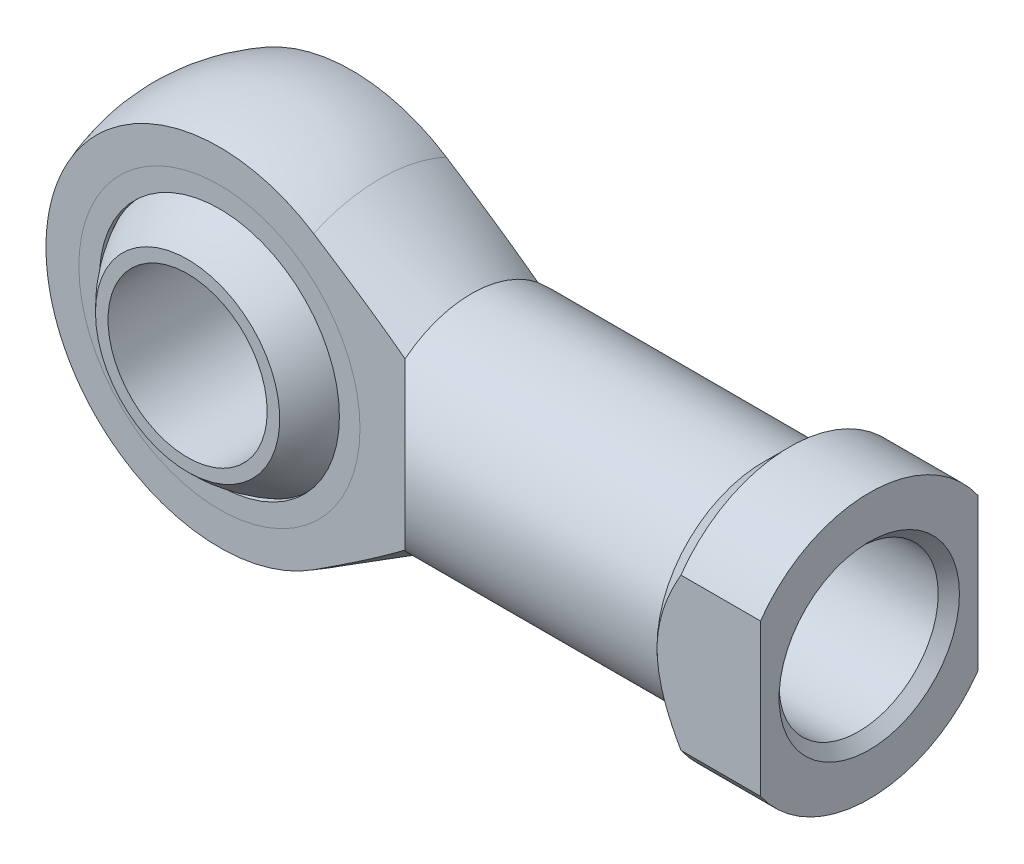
ISO-10303-21;
HEADER;
FILE_DESCRIPTION(('STEP AP214'),'2;1');
FILE_NAME('part.step','',(''),(''),'','','');
FILE_SCHEMA(('AUTOMOTIVE_DESIGN { 1 0 10303 214 1 1 1 1 }'));
ENDSEC;
DATA;
#1=APPLICATION_CONTEXT('core data for automotive mechanical design processes');
#2=APPLICATION_PROTOCOL_DEFINITION('international standard','automotive_design',2000,#1);
#3=PRODUCT_CONTEXT('',#1,'mechanical');
#4=PRODUCT('Part','Part','',(#3));
#5=PRODUCT_RELATED_PRODUCT_CATEGORY('part','',(#4));
#6=PRODUCT_DEFINITION_FORMATION('','',#4);
#7=PRODUCT_DEFINITION_CONTEXT('part definition',#1,'design');
#8=PRODUCT_DEFINITION('design','',#6,#7);
#9=PRODUCT_DEFINITION_SHAPE('','',#8);
#10=(LENGTH_UNIT() NAMED_UNIT(*) SI_UNIT(.MILLI.,.METRE.));
#11=(NAMED_UNIT(*) PLANE_ANGLE_UNIT() SI_UNIT($,.RADIAN.));
#12=(NAMED_UNIT(*) SI_UNIT($,.STERADIAN.) SOLID_ANGLE_UNIT());
#13=UNCERTAINTY_MEASURE_WITH_UNIT(LENGTH_MEASURE(1.E-05),#10,'distance_accuracy_value','');
#14=(GEOMETRIC_REPRESENTATION_CONTEXT(3) GLOBAL_UNCERTAINTY_ASSIGNED_CONTEXT((#13)) GLOBAL_UNIT_ASSIGNED_CONTEXT((#10,
#11,#12)) REPRESENTATION_CONTEXT('',''));
#15=CARTESIAN_POINT('',(0.,0.,0.));
#16=DIRECTION('',(0.,0.,1.));
#17=DIRECTION('',(1.,0.,0.));
#18=AXIS2_PLACEMENT_3D('',#15,#16,#17);
#19=CARTESIAN_POINT('',(0.,0.,0.));
#20=DIRECTION('',(0.,1.,0.));
#21=DIRECTION('',(1.,0.,0.));
#22=AXIS2_PLACEMENT_3D('',#19,#20,#21);
#23=SPHERICAL_SURFACE('',#22,25.375);
#24=CARTESIAN_POINT('',(0.,0.,0.));
#25=DIRECTION('',(0.,0.,-1.));
#26=DIRECTION('',(-1.,0.,0.));
#27=AXIS2_PLACEMENT_3D('',#24,#25,#26);
#28=SPHERICAL_SURFACE('',#27,25.375);
#29=CARTESIAN_POINT('',(0.,0.,18.5));
#30=DIRECTION('',(0.,0.,-1.));
#31=DIRECTION('',(-1.,0.,0.));
#32=AXIS2_PLACEMENT_3D('',#29,#30,#31);
#33=CIRCLE('',#32,17.3678042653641);
#34=CARTESIAN_POINT('',(-17.3678042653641,0.,18.5));
#35=VERTEX_POINT('',#34);
#36=EDGE_CURVE('P0_E26',#35,#35,#33,.F.);
#37=ORIENTED_EDGE('',*,*,#36,.F.);
#38=EDGE_LOOP('',(#37));
#39=FACE_BOUND('',#38,.T.);
#40=CARTESIAN_POINT('',(0.,0.,-18.5));
#41=DIRECTION('',(0.,0.,1.));
#42=DIRECTION('',(1.,0.,0.));
#43=AXIS2_PLACEMENT_3D('',#40,#41,#42);
#44=CIRCLE('',#43,17.3678042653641);
#45=CARTESIAN_POINT('',(17.3678042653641,0.,-18.5));
#46=VERTEX_POINT('',#45);
#47=EDGE_CURVE('P0_E10',#46,#46,#44,.F.);
#48=ORIENTED_EDGE('',*,*,#47,.F.);
#49=EDGE_LOOP('',(#48));
#50=FACE_BOUND('',#49,.T.);
#51=ADVANCED_FACE('P0_F14',(#39,#50),#28,.T.);
#52=CARTESIAN_POINT('',(0.,0.,-25.375));
#53=DIRECTION('',(0.,0.,1.));
#54=DIRECTION('',(1.,0.,0.));
#55=AXIS2_PLACEMENT_3D('',#52,#53,#54);
#56=CYLINDRICAL_SURFACE('',#55,15.);
#57=CARTESIAN_POINT('',(0.,0.,18.5));
#58=DIRECTION('',(0.,0.,-1.));
#59=DIRECTION('',(-1.,0.,0.));
#60=AXIS2_PLACEMENT_3D('',#57,#58,#59);
#61=CIRCLE('',#60,15.);
#62=CARTESIAN_POINT('',(15.,0.,18.5));
#63=VERTEX_POINT('',#62);
#64=EDGE_CURVE('P0_E17',#63,#63,#61,.F.);
#65=CARTESIAN_POINT('',(0.,0.,-18.5));
#66=DIRECTION('',(0.,0.,1.));
#67=DIRECTION('',(1.,0.,0.));
#68=AXIS2_PLACEMENT_3D('',#65,#66,#67);
#69=CIRCLE('',#68,15.);
#70=CARTESIAN_POINT('',(15.,0.,-18.5));
#71=VERTEX_POINT('',#70);
#72=EDGE_CURVE('P0_E21',#71,#71,#69,.F.);
#73=CARTESIAN_POINT('',(15.,0.,18.5));
#74=CARTESIAN_POINT('',(15.,0.,18.1145833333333));
#75=CARTESIAN_POINT('',(15.,0.,17.7291666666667));
#76=CARTESIAN_POINT('',(15.,0.,16.9583333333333));
#77=CARTESIAN_POINT('',(15.,0.,16.5729166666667));
#78=CARTESIAN_POINT('',(15.,0.,15.8020833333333));
#79=CARTESIAN_POINT('',(15.,0.,15.4166666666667));
#80=CARTESIAN_POINT('',(15.,0.,14.6458333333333));
#81=CARTESIAN_POINT('',(15.,0.,14.2604166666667));
#82=CARTESIAN_POINT('',(15.,0.,13.4895833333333));
#83=CARTESIAN_POINT('',(15.,0.,13.1041666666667));
#84=CARTESIAN_POINT('',(15.,0.,12.3333333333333));
#85=CARTESIAN_POINT('',(15.,0.,11.9479166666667));
#86=CARTESIAN_POINT('',(15.,0.,11.1770833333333));
#87=CARTESIAN_POINT('',(15.,0.,10.7916666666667));
#88=CARTESIAN_POINT('',(15.,0.,10.0208333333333));
#89=CARTESIAN_POINT('',(15.,0.,9.63541666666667));
#90=CARTESIAN_POINT('',(15.,0.,8.86458333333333));
#91=CARTESIAN_POINT('',(15.,0.,8.47916666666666));
#92=CARTESIAN_POINT('',(15.,0.,7.70833333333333));
#93=CARTESIAN_POINT('',(15.,0.,7.32291666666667));
#94=CARTESIAN_POINT('',(15.,0.,6.55208333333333));
#95=CARTESIAN_POINT('',(15.,0.,6.16666666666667));
#96=CARTESIAN_POINT('',(15.,0.,5.39583333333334));
#97=CARTESIAN_POINT('',(15.,0.,5.01041666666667));
#98=CARTESIAN_POINT('',(15.,0.,4.23958333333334));
#99=CARTESIAN_POINT('',(15.,0.,3.85416666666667));
#100=CARTESIAN_POINT('',(15.,0.,3.08333333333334));
#101=CARTESIAN_POINT('',(15.,0.,2.69791666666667));
#102=CARTESIAN_POINT('',(15.,0.,1.92708333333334));
#103=CARTESIAN_POINT('',(15.,0.,1.54166666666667));
#104=CARTESIAN_POINT('',(15.,0.,0.770833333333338));
#105=CARTESIAN_POINT('',(15.,0.,0.38541666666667));
#106=CARTESIAN_POINT('',(15.,0.,-0.385416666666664));
#107=CARTESIAN_POINT('',(15.,0.,-0.770833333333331));
#108=CARTESIAN_POINT('',(15.,0.,-1.54166666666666));
#109=CARTESIAN_POINT('',(15.,0.,-1.92708333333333));
#110=CARTESIAN_POINT('',(15.,0.,-2.69791666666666));
#111=CARTESIAN_POINT('',(15.,0.,-3.08333333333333));
#112=CARTESIAN_POINT('',(15.,0.,-3.85416666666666));
#113=CARTESIAN_POINT('',(15.,0.,-4.23958333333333));
#114=CARTESIAN_POINT('',(15.,0.,-5.01041666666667));
#115=CARTESIAN_POINT('',(15.,0.,-5.39583333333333));
#116=CARTESIAN_POINT('',(15.,0.,-6.16666666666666));
#117=CARTESIAN_POINT('',(15.,0.,-6.55208333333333));
#118=CARTESIAN_POINT('',(15.,0.,-7.32291666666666));
#119=CARTESIAN_POINT('',(15.,0.,-7.70833333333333));
#120=CARTESIAN_POINT('',(15.,0.,-8.47916666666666));
#121=CARTESIAN_POINT('',(15.,0.,-8.86458333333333));
#122=CARTESIAN_POINT('',(15.,0.,-9.63541666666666));
#123=CARTESIAN_POINT('',(15.,0.,-10.0208333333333));
#124=CARTESIAN_POINT('',(15.,0.,-10.7916666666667));
#125=CARTESIAN_POINT('',(15.,0.,-11.1770833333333));
#126=CARTESIAN_POINT('',(15.,0.,-11.9479166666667));
#127=CARTESIAN_POINT('',(15.,0.,-12.3333333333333));
#128=CARTESIAN_POINT('',(15.,0.,-13.1041666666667));
#129=CARTESIAN_POINT('',(15.,0.,-13.4895833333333));
#130=CARTESIAN_POINT('',(15.,0.,-14.2604166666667));
#131=CARTESIAN_POINT('',(15.,0.,-14.6458333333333));
#132=CARTESIAN_POINT('',(15.,0.,-15.4166666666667));
#133=CARTESIAN_POINT('',(15.,0.,-15.8020833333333));
#134=CARTESIAN_POINT('',(15.,0.,-16.5729166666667));
#135=CARTESIAN_POINT('',(15.,0.,-16.9583333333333));
#136=CARTESIAN_POINT('',(15.,0.,-17.7291666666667));
#137=CARTESIAN_POINT('',(15.,0.,-18.1145833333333));
#138=CARTESIAN_POINT('',(15.,0.,-18.5));
#139=B_SPLINE_CURVE_WITH_KNOTS('',3,(#73,#74,#75,#76,#77,#78,#79,#80,#81,#82,#83,#84,#85,#86,
#87,#88,#89,#90,#91,#92,#93,#94,#95,#96,#97,#98,#99,#100,#101,#102,#103,#104,#105,#106,#107,
#108,#109,#110,#111,#112,#113,#114,#115,#116,#117,#118,#119,#120,#121,#122,#123,#124,#125,#126,
#127,#128,#129,#130,#131,#132,#133,#134,#135,#136,#137,#138),.UNSPECIFIED.,.F.,.F.,(4,2,2,2,2,2,
2,2,2,2,2,2,2,2,2,2,2,2,2,2,2,2,2,2,2,2,2,2,2,2,2,2,4),(0.,1.15625,2.3125,3.46875,4.625,5.78125,
6.9375,8.09375,9.25,10.40625,11.5625,12.71875,13.875,15.03125,16.1875,17.34375,18.5,19.65625,
20.8125,21.96875,23.125,24.28125,25.4375,26.59375,27.75,28.90625,30.0625,31.21875,32.375,
33.53125,34.6875,35.84375,37.),.UNSPECIFIED.);
#140=EDGE_CURVE('P0_BSEAM34',#63,#71,#139,.T.);
#141=ORIENTED_EDGE('',*,*,#64,.T.);
#142=ORIENTED_EDGE('',*,*,#72,.T.);
#143=ORIENTED_EDGE('',*,*,#140,.T.);
#144=ORIENTED_EDGE('',*,*,#140,.F.);
#145=EDGE_LOOP('',(#141,#143,#142,#144));
#146=FACE_BOUND('',#145,.T.);
#147=ADVANCED_FACE('P0_F34',(#146),#56,.F.);
#148=CARTESIAN_POINT('',(-25.375,-25.375,-18.5));
#149=DIRECTION('',(0.,0.,1.));
#150=DIRECTION('',(1.,0.,0.));
#151=AXIS2_PLACEMENT_3D('',#148,#149,#150);
#152=PLANE('',#151);
#153=ORIENTED_EDGE('',*,*,#47,.T.);
#154=EDGE_LOOP('',(#153));
#155=FACE_BOUND('',#154,.T.);
#156=ORIENTED_EDGE('',*,*,#72,.F.);
#157=EDGE_LOOP('',(#156));
#158=FACE_BOUND('',#157,.T.);
#159=ADVANCED_FACE('P0_F39',(#155,#158),#152,.F.);
#160=CARTESIAN_POINT('',(-25.375,-25.375,18.5));
#161=DIRECTION('',(0.,0.,-1.));
#162=DIRECTION('',(-1.,0.,0.));
#163=AXIS2_PLACEMENT_3D('',#160,#161,#162);
#164=PLANE('',#163);
#165=ORIENTED_EDGE('',*,*,#36,.T.);
#166=EDGE_LOOP('',(#165));
#167=FACE_BOUND('',#166,.T.);
#168=ORIENTED_EDGE('',*,*,#64,.F.);
#169=EDGE_LOOP('',(#168));
#170=FACE_BOUND('',#169,.T.);
#171=ADVANCED_FACE('P0_F37',(#167,#170),#164,.F.);
#172=CLOSED_SHELL('',(#51,#147,#159,#171));
#173=MANIFOLD_SOLID_BREP('P0_B1',#172);
#174=CARTESIAN_POINT('',(0.,0.,12.5));
#175=DIRECTION('',(0.,0.,1.));
#176=DIRECTION('',(1.,0.,0.));
#177=AXIS2_PLACEMENT_3D('',#174,#175,#176);
#178=PLANE('',#177);
#179=CARTESIAN_POINT('',(0.,0.,12.5));
#180=DIRECTION('',(0.,0.,1.));
#181=DIRECTION('',(1.,0.,0.));
#182=AXIS2_PLACEMENT_3D('',#179,#180,#181);
#183=CIRCLE('',#182,26.5);
#184=CARTESIAN_POINT('',(26.5,0.,12.5));
#185=VERTEX_POINT('',#184);
#186=EDGE_CURVE('P1_E10',#185,#185,#183,.T.);
#187=ORIENTED_EDGE('',*,*,#186,.T.);
#188=EDGE_LOOP('',(#187));
#189=FACE_BOUND('',#188,.T.);
#190=CARTESIAN_POINT('',(0.,0.,12.5));
#191=DIRECTION('',(0.,0.,1.));
#192=DIRECTION('',(1.,0.,0.));
#193=AXIS2_PLACEMENT_3D('',#190,#191,#192);
#194=CIRCLE('',#193,22.62);
#195=CARTESIAN_POINT('',(22.62,0.,12.5));
#196=VERTEX_POINT('',#195);
#197=EDGE_CURVE('P1_E25',#196,#196,#194,.T.);
#198=ORIENTED_EDGE('',*,*,#197,.F.);
#199=EDGE_LOOP('',(#198));
#200=FACE_BOUND('',#199,.T.);
#201=ADVANCED_FACE('P1_F14',(#189,#200),#178,.T.);
#202=CARTESIAN_POINT('',(0.,0.,11.5));
#203=DIRECTION('',(0.,0.,1.));
#204=DIRECTION('',(1.,0.,0.));
#205=AXIS2_PLACEMENT_3D('',#202,#203,#204);
#206=PLANE('',#205);
#207=CARTESIAN_POINT('',(0.,0.,11.5));
#208=DIRECTION('',(0.,0.,1.));
#209=DIRECTION('',(1.,0.,0.));
#210=AXIS2_PLACEMENT_3D('',#207,#208,#209);
#211=CIRCLE('',#210,26.5);
#212=CARTESIAN_POINT('',(26.5,0.,11.5));
#213=VERTEX_POINT('',#212);
#214=EDGE_CURVE('P1_E18',#213,#213,#211,.T.);
#215=ORIENTED_EDGE('',*,*,#214,.F.);
#216=EDGE_LOOP('',(#215));
#217=FACE_BOUND('',#216,.T.);
#218=CARTESIAN_POINT('',(0.,0.,11.5));
#219=DIRECTION('',(0.,0.,1.));
#220=DIRECTION('',(1.,0.,0.));
#221=AXIS2_PLACEMENT_3D('',#218,#219,#220);
#222=CIRCLE('',#221,22.62);
#223=CARTESIAN_POINT('',(22.62,0.,11.5));
#224=VERTEX_POINT('',#223);
#225=EDGE_CURVE('P1_E27',#224,#224,#222,.T.);
#226=ORIENTED_EDGE('',*,*,#225,.T.);
#227=EDGE_LOOP('',(#226));
#228=FACE_BOUND('',#227,.T.);
#229=ADVANCED_FACE('P1_F37',(#217,#228),#206,.F.);
#230=CARTESIAN_POINT('',(0.,0.,12.5));
#231=DIRECTION('',(0.,0.,-1.));
#232=DIRECTION('',(-1.,0.,0.));
#233=AXIS2_PLACEMENT_3D('',#230,#231,#232);
#234=CYLINDRICAL_SURFACE('',#233,26.5);
#235=ORIENTED_EDGE('',*,*,#186,.F.);
#236=EDGE_LOOP('',(#235));
#237=FACE_BOUND('',#236,.T.);
#238=ORIENTED_EDGE('',*,*,#214,.T.);
#239=EDGE_LOOP('',(#238));
#240=FACE_BOUND('',#239,.T.);
#241=ADVANCED_FACE('P1_F16',(#237,#240),#234,.T.);
#242=CARTESIAN_POINT('',(0.,0.,12.5));
#243=DIRECTION('',(0.,0.,-1.));
#244=DIRECTION('',(-1.,0.,0.));
#245=AXIS2_PLACEMENT_3D('',#242,#243,#244);
#246=CYLINDRICAL_SURFACE('',#245,22.62);
#247=ORIENTED_EDGE('',*,*,#197,.T.);
#248=EDGE_LOOP('',(#247));
#249=FACE_BOUND('',#248,.T.);
#250=ORIENTED_EDGE('',*,*,#225,.F.);
#251=EDGE_LOOP('',(#250));
#252=FACE_BOUND('',#251,.T.);
#253=ADVANCED_FACE('P1_F33',(#249,#252),#246,.F.);
#254=CLOSED_SHELL('',(#201,#229,#241,#253));
#255=MANIFOLD_SOLID_BREP('P1_B1',#254);
#256=CARTESIAN_POINT('',(0.,0.,-11.5));
#257=DIRECTION('',(0.,0.,1.));
#258=DIRECTION('',(1.,0.,0.));
#259=AXIS2_PLACEMENT_3D('',#256,#257,#258);
#260=PLANE('',#259);
#261=CARTESIAN_POINT('',(0.,0.,-11.5));
#262=DIRECTION('',(0.,0.,1.));
#263=DIRECTION('',(1.,0.,0.));
#264=AXIS2_PLACEMENT_3D('',#261,#262,#263);
#265=CIRCLE('',#264,26.5);
#266=CARTESIAN_POINT('',(26.5,0.,-11.5));
#267=VERTEX_POINT('',#266);
#268=EDGE_CURVE('P2_E10',#267,#267,#265,.T.);
#269=ORIENTED_EDGE('',*,*,#268,.T.);
#270=EDGE_LOOP('',(#269));
#271=FACE_BOUND('',#270,.T.);
#272=CARTESIAN_POINT('',(0.,0.,-11.5));
#273=DIRECTION('',(0.,0.,1.));
#274=DIRECTION('',(1.,0.,0.));
#275=AXIS2_PLACEMENT_3D('',#272,#273,#274);
#276=CIRCLE('',#275,22.62);
#277=CARTESIAN_POINT('',(22.62,0.,-11.5));
#278=VERTEX_POINT('',#277);
#279=EDGE_CURVE('P2_E25',#278,#278,#276,.T.);
#280=ORIENTED_EDGE('',*,*,#279,.F.);
#281=EDGE_LOOP('',(#280));
#282=FACE_BOUND('',#281,.T.);
#283=ADVANCED_FACE('P2_F14',(#271,#282),#260,.T.);
#284=CARTESIAN_POINT('',(0.,0.,-12.5));
#285=DIRECTION('',(0.,0.,1.));
#286=DIRECTION('',(1.,0.,0.));
#287=AXIS2_PLACEMENT_3D('',#284,#285,#286);
#288=PLANE('',#287);
#289=CARTESIAN_POINT('',(0.,0.,-12.5));
#290=DIRECTION('',(0.,0.,1.));
#291=DIRECTION('',(1.,0.,0.));
#292=AXIS2_PLACEMENT_3D('',#289,#290,#291);
#293=CIRCLE('',#292,26.5);
#294=CARTESIAN_POINT('',(26.5,0.,-12.5));
#295=VERTEX_POINT('',#294);
#296=EDGE_CURVE('P2_E18',#295,#295,#293,.T.);
#297=ORIENTED_EDGE('',*,*,#296,.F.);
#298=EDGE_LOOP('',(#297));
#299=FACE_BOUND('',#298,.T.);
#300=CARTESIAN_POINT('',(0.,0.,-12.5));
#301=DIRECTION('',(0.,0.,1.));
#302=DIRECTION('',(1.,0.,0.));
#303=AXIS2_PLACEMENT_3D('',#300,#301,#302);
#304=CIRCLE('',#303,22.62);
#305=CARTESIAN_POINT('',(22.62,0.,-12.5));
#306=VERTEX_POINT('',#305);
#307=EDGE_CURVE('P2_E27',#306,#306,#304,.T.);
#308=ORIENTED_EDGE('',*,*,#307,.T.);
#309=EDGE_LOOP('',(#308));
#310=FACE_BOUND('',#309,.T.);
#311=ADVANCED_FACE('P2_F37',(#299,#310),#288,.F.);
#312=CARTESIAN_POINT('',(0.,0.,-11.5));
#313=DIRECTION('',(0.,0.,-1.));
#314=DIRECTION('',(-1.,0.,0.));
#315=AXIS2_PLACEMENT_3D('',#312,#313,#314);
#316=CYLINDRICAL_SURFACE('',#315,26.5);
#317=ORIENTED_EDGE('',*,*,#268,.F.);
#318=EDGE_LOOP('',(#317));
#319=FACE_BOUND('',#318,.T.);
#320=ORIENTED_EDGE('',*,*,#296,.T.);
#321=EDGE_LOOP('',(#320));
#322=FACE_BOUND('',#321,.T.);
#323=ADVANCED_FACE('P2_F16',(#319,#322),#316,.T.);
#324=CARTESIAN_POINT('',(0.,0.,-11.5));
#325=DIRECTION('',(0.,0.,-1.));
#326=DIRECTION('',(-1.,0.,0.));
#327=AXIS2_PLACEMENT_3D('',#324,#325,#326);
#328=CYLINDRICAL_SURFACE('',#327,22.62);
#329=ORIENTED_EDGE('',*,*,#279,.T.);
#330=EDGE_LOOP('',(#329));
#331=FACE_BOUND('',#330,.T.);
#332=ORIENTED_EDGE('',*,*,#307,.F.);
#333=EDGE_LOOP('',(#332));
#334=FACE_BOUND('',#333,.T.);
#335=ADVANCED_FACE('P2_F33',(#331,#334),#328,.F.);
#336=CLOSED_SHELL('',(#283,#311,#323,#335));
#337=MANIFOLD_SOLID_BREP('P2_B1',#336);
#338=CARTESIAN_POINT('',(0.,0.,0.));
#339=DIRECTION('',(0.,1.,0.));
#340=DIRECTION('',(1.,0.,0.));
#341=AXIS2_PLACEMENT_3D('',#338,#339,#340);
#342=SPHERICAL_SURFACE('',#341,25.375);
#343=CARTESIAN_POINT('',(0.,0.,0.));
#344=DIRECTION('',(0.,0.,1.));
#345=DIRECTION('',(1.,0.,0.));
#346=AXIS2_PLACEMENT_3D('',#343,#344,#345);
#347=SPHERICAL_SURFACE('',#346,25.375);
#348=CARTESIAN_POINT('',(0.,0.,11.5));
#349=DIRECTION('',(0.,0.,1.));
#350=DIRECTION('',(1.,0.,0.));
#351=AXIS2_PLACEMENT_3D('',#348,#349,#350);
#352=CIRCLE('',#351,22.6194744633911);
#353=CARTESIAN_POINT('',(22.6194744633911,0.,11.5));
#354=VERTEX_POINT('',#353);
#355=EDGE_CURVE('P3_E73',#354,#354,#352,.F.);
#356=ORIENTED_EDGE('',*,*,#355,.F.);
#357=EDGE_LOOP('',(#356));
#358=FACE_BOUND('',#357,.T.);
#359=CARTESIAN_POINT('',(0.,0.,-11.5));
#360=DIRECTION('',(0.,0.,-1.));
#361=DIRECTION('',(-1.,0.,0.));
#362=AXIS2_PLACEMENT_3D('',#359,#360,#361);
#363=CIRCLE('',#362,22.6194744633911);
#364=CARTESIAN_POINT('',(-22.6194744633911,0.,-11.5));
#365=VERTEX_POINT('',#364);
#366=EDGE_CURVE('P3_E20',#365,#365,#363,.F.);
#367=ORIENTED_EDGE('',*,*,#366,.F.);
#368=EDGE_LOOP('',(#367));
#369=FACE_BOUND('',#368,.T.);
#370=ADVANCED_FACE('P3_F16',(#358,#369),#347,.F.);
#371=CARTESIAN_POINT('',(-35.,-35.,-12.5));
#372=DIRECTION('',(0.,0.,1.));
#373=DIRECTION('',(1.,0.,0.));
#374=AXIS2_PLACEMENT_3D('',#371,#372,#373);
#375=PLANE('',#374);
#376=CARTESIAN_POINT('',(0.,0.,-12.5));
#377=DIRECTION('',(0.,0.,1.));
#378=DIRECTION('',(1.,0.,0.));
#379=AXIS2_PLACEMENT_3D('',#376,#377,#378);
#380=CIRCLE('',#379,32.6917420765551);
#381=CARTESIAN_POINT('',(17.7692307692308,27.4409263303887,-12.5));
#382=VERTEX_POINT('',#381);
#383=CARTESIAN_POINT('',(17.7692307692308,-27.4409263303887,-12.5));
#384=VERTEX_POINT('',#383);
#385=EDGE_CURVE('P3_E11',#382,#384,#380,.T.);
#386=ORIENTED_EDGE('',*,*,#385,.F.);
#387=CARTESIAN_POINT('',(-58.8710072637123,-74.2723160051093,-12.5));
#388=CARTESIAN_POINT('',(-56.7404576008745,-72.9991436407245,-12.5));
#389=CARTESIAN_POINT('',(-54.6102936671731,-71.7253253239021,-12.5));
#390=CARTESIAN_POINT('',(-50.3508937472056,-69.1761264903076,-12.5));
#391=CARTESIAN_POINT('',(-48.2216577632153,-67.900745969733,-12.5));
#392=CARTESIAN_POINT('',(-43.9622786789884,-65.3469583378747,-12.5));
#393=CARTESIAN_POINT('',(-41.8321366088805,-64.0685495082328,-12.5));
#394=CARTESIAN_POINT('',(-37.5731688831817,-61.5095509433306,-12.5));
#395=CARTESIAN_POINT('',(-35.4443432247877,-60.2289612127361,-12.5));
#396=CARTESIAN_POINT('',(-31.1699562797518,-57.6541168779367,-12.5));
#397=CARTESIAN_POINT('',(-29.0244086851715,-56.3598395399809,-12.5));
#398=CARTESIAN_POINT('',(-24.7352748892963,-53.7680079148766,-12.5));
#399=CARTESIAN_POINT('',(-22.5916887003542,-52.4704536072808,-12.5));
#400=CARTESIAN_POINT('',(-18.3089368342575,-49.8724817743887,-12.5));
#401=CARTESIAN_POINT('',(-16.1697689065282,-48.5720679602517,-12.5));
#402=CARTESIAN_POINT('',(-11.8945885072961,-45.966169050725,-12.5));
#403=CARTESIAN_POINT('',(-9.75857596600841,-44.6606840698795,-12.5));
#404=CARTESIAN_POINT('',(-5.49386159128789,-42.0451664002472,-12.5));
#405=CARTESIAN_POINT('',(-3.36515356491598,-40.7351438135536,-12.5));
#406=CARTESIAN_POINT('',(0.887132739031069,-38.1063901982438,-12.5));
#407=CARTESIAN_POINT('',(3.01071057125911,-36.7876584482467,-12.5));
#408=CARTESIAN_POINT('',(6.19358205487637,-34.7989159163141,-12.5));
#409=CARTESIAN_POINT('',(7.25561271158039,-34.1332855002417,-12.5));
#410=CARTESIAN_POINT('',(9.37747531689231,-32.7985304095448,-12.5));
#411=CARTESIAN_POINT('',(10.437307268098,-32.129405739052,-12.5));
#412=CARTESIAN_POINT('',(12.5540207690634,-30.7871927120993,-12.5));
#413=CARTESIAN_POINT('',(13.6109030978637,-30.1141055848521,-12.5));
#414=CARTESIAN_POINT('',(15.7214506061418,-28.7629162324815,-12.5));
#415=CARTESIAN_POINT('',(16.7751158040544,-28.0848140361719,-12.5));
#416=CARTESIAN_POINT('',(18.8765574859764,-26.7237205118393,-12.5));
#417=CARTESIAN_POINT('',(19.9243412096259,-26.0407403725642,-12.5));
#418=CARTESIAN_POINT('',(22.0149562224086,-24.667182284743,-12.5));
#419=CARTESIAN_POINT('',(23.0577873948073,-23.976604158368,-12.5));
#420=CARTESIAN_POINT('',(25.1382819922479,-22.5850735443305,-12.5));
#421=CARTESIAN_POINT('',(26.1759379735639,-21.8841098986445,-12.5));
#422=CARTESIAN_POINT('',(27.726024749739,-20.8233940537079,-12.5));
#423=CARTESIAN_POINT('',(28.2416366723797,-20.4682893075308,-12.5));
#424=CARTESIAN_POINT('',(29.2703837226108,-19.7545119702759,-12.5));
#425=CARTESIAN_POINT('',(29.7835188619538,-19.3958393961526,-12.5));
#426=CARTESIAN_POINT('',(30.8041169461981,-18.6763315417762,-12.5));
#427=CARTESIAN_POINT('',(31.3115955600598,-18.3155185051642,-12.5));
#428=CARTESIAN_POINT('',(32.3231507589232,-17.5891593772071,-12.5));
#429=CARTESIAN_POINT('',(32.8272273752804,-17.2236133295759,-12.5));
#430=CARTESIAN_POINT('',(33.8314839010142,-16.4868413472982,-12.5));
#431=CARTESIAN_POINT('',(34.3316624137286,-16.1156135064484,-12.5));
#432=CARTESIAN_POINT('',(35.3270704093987,-15.3665838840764,-12.5));
#433=CARTESIAN_POINT('',(35.8222999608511,-14.9887821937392,-12.5));
#434=CARTESIAN_POINT('',(36.8056627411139,-14.2260865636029,-12.5));
#435=CARTESIAN_POINT('',(37.2938083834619,-13.8412086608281,-12.5));
#436=CARTESIAN_POINT('',(38.2625244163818,-13.0619403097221,-12.5));
#437=CARTESIAN_POINT('',(38.7430943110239,-12.6675492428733,-12.5));
#438=CARTESIAN_POINT('',(39.6941816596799,-11.8673881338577,-12.5));
#439=CARTESIAN_POINT('',(40.164705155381,-11.4616252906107,-12.5));
#440=CARTESIAN_POINT('',(41.0929210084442,-10.6357216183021,-12.5));
#441=CARTESIAN_POINT('',(41.5506157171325,-10.2155834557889,-12.5));
#442=CARTESIAN_POINT('',(42.1143528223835,-9.67667483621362,-12.5));
#443=CARTESIAN_POINT('',(42.2285319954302,-9.56638802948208,-12.5));
#444=CARTESIAN_POINT('',(42.4556501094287,-9.34454010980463,-12.5));
#445=CARTESIAN_POINT('',(42.5685890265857,-9.23297897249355,-12.5));
#446=CARTESIAN_POINT('',(42.9054061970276,-8.89624731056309,-12.5));
#447=CARTESIAN_POINT('',(43.1272655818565,-8.6690469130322,-12.5));
#448=CARTESIAN_POINT('',(43.5648187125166,-8.20822638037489,-12.5));
#449=CARTESIAN_POINT('',(43.7805043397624,-7.97459851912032,-12.5));
#450=CARTESIAN_POINT('',(44.2040723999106,-7.50036254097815,-12.5));
#451=CARTESIAN_POINT('',(44.4119551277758,-7.25975468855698,-12.5));
#452=CARTESIAN_POINT('',(44.8159659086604,-6.77329634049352,-12.5));
#453=CARTESIAN_POINT('',(45.0121982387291,-6.52753281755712,-12.5));
#454=CARTESIAN_POINT('',(45.3932396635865,-6.02719362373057,-12.5));
#455=CARTESIAN_POINT('',(45.5780469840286,-5.77261659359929,-12.5));
#456=CARTESIAN_POINT('',(45.9330781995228,-5.25417414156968,-12.5));
#457=CARTESIAN_POINT('',(46.1033304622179,-4.99032827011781,-12.5));
#458=CARTESIAN_POINT('',(46.4260719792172,-4.45205206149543,-12.5));
#459=CARTESIAN_POINT('',(46.578570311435,-4.17762722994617,-12.5));
#460=CARTESIAN_POINT('',(46.8318836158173,-3.67614838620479,-12.5));
#461=CARTESIAN_POINT('',(46.9368371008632,-3.45119233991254,-12.5));
#462=CARTESIAN_POINT('',(47.1303996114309,-2.99430237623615,-12.5));
#463=CARTESIAN_POINT('',(47.2190094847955,-2.76236882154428,-12.5));
#464=CARTESIAN_POINT('',(47.377092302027,-2.29226594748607,-12.5));
#465=CARTESIAN_POINT('',(47.4465844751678,-2.05410315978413,-12.5));
#466=CARTESIAN_POINT('',(47.5639018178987,-1.57251527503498,-12.5));
#467=CARTESIAN_POINT('',(47.6117336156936,-1.32909181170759,-12.5));
#468=CARTESIAN_POINT('',(47.6840388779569,-0.835831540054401,-12.5));
#469=CARTESIAN_POINT('',(47.7082316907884,-0.585952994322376,-12.5));
#470=CARTESIAN_POINT('',(47.7310362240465,-0.0850334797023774,-12.5));
#471=CARTESIAN_POINT('',(47.7296497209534,0.166007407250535,-12.5));
#472=CARTESIAN_POINT('',(47.7013634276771,0.666792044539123,-12.5));
#473=CARTESIAN_POINT('',(47.6744471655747,0.916534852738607,-12.5));
#474=CARTESIAN_POINT('',(47.5964421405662,1.41220087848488,-12.5));
#475=CARTESIAN_POINT('',(47.5453492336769,1.65812343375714,-12.5));
#476=CARTESIAN_POINT('',(47.4128539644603,2.17736703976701,-12.5));
#477=CARTESIAN_POINT('',(47.3282774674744,2.449872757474,-12.5));
#478=CARTESIAN_POINT('',(47.1349451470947,2.98610708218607,-12.5));
#479=CARTESIAN_POINT('',(47.0261835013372,3.24983355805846,-12.5));
#480=CARTESIAN_POINT('',(46.7882965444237,3.7685291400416,-12.5));
#481=CARTESIAN_POINT('',(46.659127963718,4.02347820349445,-12.5));
#482=CARTESIAN_POINT('',(46.3842422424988,4.52417827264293,-12.5));
#483=CARTESIAN_POINT('',(46.2385263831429,4.76992998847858,-12.5));
#484=CARTESIAN_POINT('',(45.8838471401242,5.33161382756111,-12.5));
#485=CARTESIAN_POINT('',(45.6697551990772,5.64429581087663,-12.5));
#486=CARTESIAN_POINT('',(45.2232891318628,6.25641273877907,-12.5));
#487=CARTESIAN_POINT('',(44.9909055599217,6.55584071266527,-12.5));
#488=CARTESIAN_POINT('',(44.511557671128,7.14365732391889,-12.5));
#489=CARTESIAN_POINT('',(44.2645667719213,7.43202415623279,-12.5));
#490=CARTESIAN_POINT('',(43.759471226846,7.99870937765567,-12.5));
#491=CARTESIAN_POINT('',(43.5013685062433,8.27702949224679,-12.5));
#492=CARTESIAN_POINT('',(42.9742864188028,8.82714179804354,-12.5));
#493=CARTESIAN_POINT('',(42.7052402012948,9.09886968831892,-12.5));
#494=CARTESIAN_POINT('',(42.159811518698,9.63485475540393,-12.5));
#495=CARTESIAN_POINT('',(41.8834287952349,9.89911166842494,-12.5));
#496=CARTESIAN_POINT('',(41.3249798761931,10.4208578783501,-12.5));
#497=CARTESIAN_POINT('',(41.0429208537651,10.6783548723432,-12.5));
#498=CARTESIAN_POINT('',(40.4738208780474,11.187749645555,-12.5));
#499=CARTESIAN_POINT('',(40.1867801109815,11.4396476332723,-12.5));
#500=CARTESIAN_POINT('',(39.5747394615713,11.9676965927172,-12.5));
#501=CARTESIAN_POINT('',(39.2492206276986,12.2432452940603,-12.5));
#502=CARTESIAN_POINT('',(38.5938069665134,12.7890969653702,-12.5));
#503=CARTESIAN_POINT('',(38.2639120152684,13.0593997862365,-12.5));
#504=CARTESIAN_POINT('',(37.6003951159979,13.5954690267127,-12.5));
#505=CARTESIAN_POINT('',(37.2667727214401,13.8612348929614,-12.5));
#506=CARTESIAN_POINT('',(36.5963769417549,14.3887657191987,-12.5));
#507=CARTESIAN_POINT('',(36.2596035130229,14.6505306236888,-12.5));
#508=CARTESIAN_POINT('',(35.2449012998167,15.4308200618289,-12.5));
#509=CARTESIAN_POINT('',(34.5629187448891,15.9440759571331,-12.5));
#510=CARTESIAN_POINT('',(33.1908509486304,16.9595077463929,-12.5));
#511=CARTESIAN_POINT('',(32.5007661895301,17.4616842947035,-12.5));
#512=CARTESIAN_POINT('',(31.1128805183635,18.4581433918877,-12.5));
#513=CARTESIAN_POINT('',(30.4150671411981,18.9524085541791,-12.5));
#514=CARTESIAN_POINT('',(29.0143573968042,19.9336902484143,-12.5));
#515=CARTESIAN_POINT('',(28.3114609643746,20.4207066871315,-12.5));
#516=CARTESIAN_POINT('',(26.901760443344,21.3886040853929,-12.5));
#517=CARTESIAN_POINT('',(26.194957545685,21.8694867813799,-12.5));
#518=CARTESIAN_POINT('',(24.7779740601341,22.8262381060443,-12.5));
#519=CARTESIAN_POINT('',(24.0677934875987,23.3021067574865,-12.5));
#520=CARTESIAN_POINT('',(22.6465316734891,24.2483318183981,-12.5));
#521=CARTESIAN_POINT('',(21.9354580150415,24.7186996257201,-12.5));
#522=CARTESIAN_POINT('',(20.5109414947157,25.6558353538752,-12.5));
#523=CARTESIAN_POINT('',(19.7974986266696,26.122603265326,-12.5));
#524=CARTESIAN_POINT('',(17.6540653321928,27.5183419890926,-12.5));
#525=CARTESIAN_POINT('',(16.2210622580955,28.4426867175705,-12.5));
#526=CARTESIAN_POINT('',(13.3507658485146,30.2809909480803,-12.5));
#527=CARTESIAN_POINT('',(11.913479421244,31.1949612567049,-12.5));
#528=CARTESIAN_POINT('',(9.75413375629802,32.5604703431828,-12.5));
#529=CARTESIAN_POINT('',(9.03379115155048,33.0147269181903,-12.5));
#530=CARTESIAN_POINT('',(7.59208903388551,33.9216230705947,-12.5));
#531=CARTESIAN_POINT('',(6.87072952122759,34.3742626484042,-12.5));
#532=CARTESIAN_POINT('',(4.54768433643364,35.8287132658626,-12.5));
#533=CARTESIAN_POINT('',(2.94423678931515,36.8277107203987,-12.5));
#534=CARTESIAN_POINT('',(-0.266108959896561,38.8201478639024,-12.5));
#535=CARTESIAN_POINT('',(-1.87300716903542,39.813587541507,-12.5));
#536=CARTESIAN_POINT('',(-5.0895680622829,41.7960038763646,-12.5));
#537=CARTESIAN_POINT('',(-6.69923076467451,42.784980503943,-12.5));
#538=CARTESIAN_POINT('',(-9.92079022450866,44.7592893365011,-12.5));
#539=CARTESIAN_POINT('',(-11.5326869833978,45.7446215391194,-12.5));
#540=CARTESIAN_POINT('',(-14.7583707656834,47.7123062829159,-12.5));
#541=CARTESIAN_POINT('',(-16.3721578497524,48.6946587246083,-12.5));
#542=CARTESIAN_POINT('',(-19.6012648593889,50.6568414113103,-12.5));
#543=CARTESIAN_POINT('',(-21.2165847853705,51.6366716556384,-12.5));
#544=CARTESIAN_POINT('',(-26.0644550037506,54.5729776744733,-12.5));
#545=CARTESIAN_POINT('',(-29.2989292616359,56.5262769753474,-12.5));
#546=CARTESIAN_POINT('',(-35.7735941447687,60.427889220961,-12.5));
#547=CARTESIAN_POINT('',(-39.0137870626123,62.3761983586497,-12.5));
#548=CARTESIAN_POINT('',(-45.4969902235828,66.2681290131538,-12.5));
#549=CARTESIAN_POINT('',(-48.7400004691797,68.2117505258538,-12.5));
#550=CARTESIAN_POINT('',(-55.2281355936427,72.0953320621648,-12.5));
#551=CARTESIAN_POINT('',(-58.4732604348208,74.0352921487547,-12.5));
#552=CARTESIAN_POINT('',(-64.9652222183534,77.9123458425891,-12.5));
#553=CARTESIAN_POINT('',(-68.2120591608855,79.8494394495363,-12.5));
#554=CARTESIAN_POINT('',(-74.6775843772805,83.7037247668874,-12.5));
#555=CARTESIAN_POINT('',(-77.8962602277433,85.6209373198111,-12.5));
#556=CARTESIAN_POINT('',(-84.3347141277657,89.4535109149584,-12.5));
#557=CARTESIAN_POINT('',(-87.5544921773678,91.3688719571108,-12.5));
#558=CARTESIAN_POINT('',(-97.2152186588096,97.1126943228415,-12.5));
#559=CARTESIAN_POINT('',(-103.657523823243,100.938873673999,-12.5));
#560=CARTESIAN_POINT('',(-116.540121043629,108.58424162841,-12.5));
#561=CARTESIAN_POINT('',(-122.980411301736,112.403433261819,-12.5));
#562=CARTESIAN_POINT('',(-132.642231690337,118.129838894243,-12.5));
#563=CARTESIAN_POINT('',(-135.863059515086,120.03823799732,-12.5));
#564=CARTESIAN_POINT('',(-142.305124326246,123.854345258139,-12.5));
#565=CARTESIAN_POINT('',(-145.526361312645,125.762053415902,-12.5));
#566=CARTESIAN_POINT('',(-148.747773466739,127.669465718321,-12.5));
#567=B_SPLINE_CURVE_WITH_KNOTS('',3,(#387,#388,#389,#390,#391,#392,#393,#394,#395,#396,#397,
#398,#399,#400,#401,#402,#403,#404,#405,#406,#407,#408,#409,#410,#411,#412,#413,#414,#415,#416,
#417,#418,#419,#420,#421,#422,#423,#424,#425,#426,#427,#428,#429,#430,#431,#432,#433,#434,#435,
#436,#437,#438,#439,#440,#441,#442,#443,#444,#445,#446,#447,#448,#449,#450,#451,#452,#453,#454,
#455,#456,#457,#458,#459,#460,#461,#462,#463,#464,#465,#466,#467,#468,#469,#470,#471,#472,#473,
#474,#475,#476,#477,#478,#479,#480,#481,#482,#483,#484,#485,#486,#487,#488,#489,#490,#491,#492,
#493,#494,#495,#496,#497,#498,#499,#500,#501,#502,#503,#504,#505,#506,#507,#508,#509,#510,#511,
#512,#513,#514,#515,#516,#517,#518,#519,#520,#521,#522,#523,#524,#525,#526,#527,#528,#529,#530,
#531,#532,#533,#534,#535,#536,#537,#538,#539,#540,#541,#542,#543,#544,#545,#546,#547,#548,#549,
#550,#551,#552,#553,#554,#555,#556,#557,#558,#559,#560,#561,#562,#563,#564,#565,#566),
.UNSPECIFIED.,.F.,.F.,(4,2,2,2,2,2,2,2,2,2,2,2,2,2,2,2,2,2,2,2,2,2,2,2,2,2,2,2,2,2,2,2,2,2,2,2,
2,2,2,2,2,2,2,2,2,2,2,2,2,2,2,2,2,2,2,2,2,2,2,2,2,2,2,2,2,2,2,2,2,2,2,2,2,2,2,2,2,2,2,2,2,2,2,2,
2,2,2,2,2,4),(0.,7.44593118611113,14.8918805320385,22.3448324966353,29.7977685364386,
37.3148636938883,44.8320058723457,52.3422627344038,59.8523509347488,67.3508713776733,
74.8500209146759,78.6101694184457,82.3703134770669,86.129346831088,89.8883586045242,
93.6405063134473,97.3927420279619,101.149353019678,103.027530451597,104.905698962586,
106.773692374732,108.641668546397,110.510285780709,112.378877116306,114.243657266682,
116.108558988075,117.972305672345,119.835708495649,120.311936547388,120.788173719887,
121.740727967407,122.694482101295,123.64820014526,124.591410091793,125.534766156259,
126.476239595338,127.417229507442,128.161394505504,128.90552088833,129.648896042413,
130.392043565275,131.143910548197,131.895725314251,132.648025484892,133.400454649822,
134.255079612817,135.109910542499,135.966578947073,136.823181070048,137.959144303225,
139.095698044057,140.234387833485,141.372881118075,142.519879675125,143.666918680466,
144.812589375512,145.958217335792,147.237607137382,148.517033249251,149.79661431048,
151.076213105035,153.636672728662,156.196980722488,158.762303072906,161.327658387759,
163.89227057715,166.45687111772,169.014561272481,171.572258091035,176.68798310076,
181.797771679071,184.352604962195,186.907437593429,192.574992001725,198.242557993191,
203.910161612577,209.577768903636,215.245563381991,220.913359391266,232.248903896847,
243.591422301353,254.933950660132,266.27628210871,277.618614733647,288.857840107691,
300.09706591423,322.575641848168,345.038322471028,356.269594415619,367.500865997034),.UNSPECIFIED.);
#568=CARTESIAN_POINT('',(35.,15.612494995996,-12.5));
#569=VERTEX_POINT('',#568);
#570=EDGE_CURVE('P3_E102',#569,#382,#567,.T.);
#571=ORIENTED_EDGE('',*,*,#570,.F.);
#572=DIRECTION('',(0.,1.,0.));
#573=VECTOR('',#572,1.);
#574=CARTESIAN_POINT('',(35.,-35.,-12.5));
#575=LINE('',#574,#573);
#576=CARTESIAN_POINT('',(35.,-15.612494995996,-12.5));
#577=VERTEX_POINT('',#576);
#578=EDGE_CURVE('P3_E64',#577,#569,#575,.T.);
#579=ORIENTED_EDGE('',*,*,#578,.F.);
#580=EDGE_CURVE('P3_E33',#384,#577,#567,.T.);
#581=ORIENTED_EDGE('',*,*,#580,.F.);
#582=EDGE_LOOP('',(#386,#571,#579,#581));
#583=FACE_BOUND('',#582,.T.);
#584=CARTESIAN_POINT('',(0.,0.,-12.5));
#585=DIRECTION('',(0.,0.,1.));
#586=DIRECTION('',(1.,0.,0.));
#587=AXIS2_PLACEMENT_3D('',#584,#585,#586);
#588=CIRCLE('',#587,26.5);
#589=CARTESIAN_POINT('',(26.5,0.,-12.5));
#590=VERTEX_POINT('',#589);
#591=EDGE_CURVE('P3_E95',#590,#590,#588,.T.);
#592=ORIENTED_EDGE('',*,*,#591,.T.);
#593=EDGE_LOOP('',(#592));
#594=FACE_BOUND('',#593,.T.);
#595=ADVANCED_FACE('P3_F125',(#583,#594),#375,.F.);
#596=CARTESIAN_POINT('',(35.,0.,0.));
#597=DIRECTION('',(-1.,0.,0.));
#598=DIRECTION('',(0.,0.,1.));
#599=AXIS2_PLACEMENT_3D('',#596,#597,#598);
#600=CONICAL_SURFACE('',#599,20.,0.532504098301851);
#601=CARTESIAN_POINT('',(17.7692307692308,0.,0.));
#602=DIRECTION('',(-1.,0.,0.));
#603=DIRECTION('',(0.,0.,1.));
#604=AXIS2_PLACEMENT_3D('',#601,#602,#603);
#605=CIRCLE('',#604,30.1538461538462);
#606=CARTESIAN_POINT('',(17.7692307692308,-27.4409263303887,12.5));
#607=VERTEX_POINT('',#606);
#608=EDGE_CURVE('P3_E79',#384,#607,#605,.T.);
#609=ORIENTED_EDGE('',*,*,#608,.F.);
#610=ORIENTED_EDGE('',*,*,#580,.T.);
#611=CARTESIAN_POINT('',(35.,0.,0.));
#612=DIRECTION('',(-1.,0.,0.));
#613=DIRECTION('',(0.,0.,1.));
#614=AXIS2_PLACEMENT_3D('',#611,#612,#613);
#615=CIRCLE('',#614,20.);
#616=CARTESIAN_POINT('',(35.,-15.612494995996,12.5));
#617=VERTEX_POINT('',#616);
#618=EDGE_CURVE('P3_E70',#577,#617,#615,.T.);
#619=ORIENTED_EDGE('',*,*,#618,.T.);
#620=CARTESIAN_POINT('',(-71.3155760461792,-81.6995339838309,12.5));
#621=CARTESIAN_POINT('',(-68.9737254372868,-80.3034440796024,12.5));
#622=CARTESIAN_POINT('',(-66.6322246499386,-78.9067670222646,12.5));
#623=CARTESIAN_POINT('',(-61.9500654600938,-76.1119943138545,12.5));
#624=CARTESIAN_POINT('',(-59.6094070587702,-74.7138986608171,12.5));
#625=CARTESIAN_POINT('',(-54.9278244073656,-71.9152966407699,12.5));
#626=CARTESIAN_POINT('',(-52.5869006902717,-70.5147893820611,12.5));
#627=CARTESIAN_POINT('',(-47.9062423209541,-67.7117953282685,12.5));
#628=CARTESIAN_POINT('',(-45.5665076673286,-66.3093085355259,12.5));
#629=CARTESIAN_POINT('',(-40.8742302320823,-63.4934053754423,12.5));
#630=CARTESIAN_POINT('',(-38.5216961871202,-62.0799744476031,12.5));
#631=CARTESIAN_POINT('',(-33.8184007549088,-59.2501664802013,12.5));
#632=CARTESIAN_POINT('',(-31.4676393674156,-57.8337894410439,12.5));
#633=CARTESIAN_POINT('',(-26.7695401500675,-54.9981241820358,12.5));
#634=CARTESIAN_POINT('',(-24.4222011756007,-53.5788378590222,12.5));
#635=CARTESIAN_POINT('',(-19.7303309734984,-50.735694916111,12.5));
#636=CARTESIAN_POINT('',(-17.3857997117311,-49.3118383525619,12.5));
#637=CARTESIAN_POINT('',(-12.7024131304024,-46.4595042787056,12.5));
#638=CARTESIAN_POINT('',(-10.363554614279,-45.0310320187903,12.5));
#639=CARTESIAN_POINT('',(-5.690453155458,-42.1663085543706,12.5));
#640=CARTESIAN_POINT('',(-3.35621043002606,-40.7300569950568,12.5));
#641=CARTESIAN_POINT('',(0.142165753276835,-38.5666740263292,12.5));
#642=CARTESIAN_POINT('',(1.30872416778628,-37.8434639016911,12.5));
#643=CARTESIAN_POINT('',(3.63990579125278,-36.3939321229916,12.5));
#644=CARTESIAN_POINT('',(4.80452900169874,-35.6676104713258,12.5));
#645=CARTESIAN_POINT('',(7.13127459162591,-34.2113866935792,12.5));
#646=CARTESIAN_POINT('',(8.29339734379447,-33.4814851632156,12.5));
#647=CARTESIAN_POINT('',(10.6148349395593,-32.0172356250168,12.5));
#648=CARTESIAN_POINT('',(11.7741497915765,-31.2828876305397,12.5));
#649=CARTESIAN_POINT('',(14.086995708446,-29.8102579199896,12.5));
#650=CARTESIAN_POINT('',(15.2405337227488,-29.0719871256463,12.5));
#651=CARTESIAN_POINT('',(17.5433319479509,-27.5887653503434,12.5));
#652=CARTESIAN_POINT('',(18.6925921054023,-26.8438142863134,12.5));
#653=CARTESIAN_POINT('',(20.9863696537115,-25.3450449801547,12.5));
#654=CARTESIAN_POINT('',(22.1308835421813,-24.5912213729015,12.5));
#655=CARTESIAN_POINT('',(24.4127260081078,-23.0728448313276,12.5));
#656=CARTESIAN_POINT('',(25.5500548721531,-22.3082923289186,12.5));
#657=CARTESIAN_POINT('',(27.247076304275,-21.1520072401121,12.5));
#658=CARTESIAN_POINT('',(27.8103991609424,-20.7656016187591,12.5));
#659=CARTESIAN_POINT('',(28.934207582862,-19.9886886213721,12.5));
#660=CARTESIAN_POINT('',(29.4946931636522,-19.5981812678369,12.5));
#661=CARTESIAN_POINT('',(30.6124037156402,-18.8123076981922,12.5));
#662=CARTESIAN_POINT('',(31.1696280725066,-18.4169406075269,12.5));
#663=CARTESIAN_POINT('',(32.280028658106,-17.620563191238,12.5));
#664=CARTESIAN_POINT('',(32.8332049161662,-17.2195529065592,12.5));
#665=CARTESIAN_POINT('',(33.9340136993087,-16.4112617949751,12.5));
#666=CARTESIAN_POINT('',(34.481651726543,-16.0039884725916,12.5));
#667=CARTESIAN_POINT('',(35.5708606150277,-15.1813506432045,12.5));
#668=CARTESIAN_POINT('',(36.1124312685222,-14.7659858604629,12.5));
#669=CARTESIAN_POINT('',(37.187708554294,-13.9255448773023,12.5));
#670=CARTESIAN_POINT('',(37.7214177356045,-13.5004719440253,12.5));
#671=CARTESIAN_POINT('',(38.7789096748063,-12.6381796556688,12.5));
#672=CARTESIAN_POINT('',(39.3026934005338,-12.2009614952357,12.5));
#673=CARTESIAN_POINT('',(39.9506440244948,-11.6436162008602,12.5));
#674=CARTESIAN_POINT('',(40.0809858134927,-11.5306489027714,12.5));
#675=CARTESIAN_POINT('',(40.3407553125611,-11.3036659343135,12.5));
#676=CARTESIAN_POINT('',(40.4701830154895,-11.1896502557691,12.5));
#677=CARTESIAN_POINT('',(40.8570005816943,-10.8459232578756,12.5));
#678=CARTESIAN_POINT('',(41.1129124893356,-10.6145426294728,12.5));
#679=CARTESIAN_POINT('',(41.6202575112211,-10.1465778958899,12.5));
#680=CARTESIAN_POINT('',(41.8716875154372,-9.90999041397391,12.5));
#681=CARTESIAN_POINT('',(42.3690033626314,-9.43105533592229,12.5));
#682=CARTESIAN_POINT('',(42.614889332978,-9.18870787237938,12.5));
#683=CARTESIAN_POINT('',(43.0987875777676,-8.69863710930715,12.5));
#684=CARTESIAN_POINT('',(43.3368329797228,-8.45094661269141,12.5));
#685=CARTESIAN_POINT('',(43.8048802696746,-7.94808601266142,12.5));
#686=CARTESIAN_POINT('',(44.0348827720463,-7.69291648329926,12.5));
#687=CARTESIAN_POINT('',(44.4847973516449,-7.1742047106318,12.5));
#688=CARTESIAN_POINT('',(44.7047184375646,-6.9106703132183,12.5));
#689=CARTESIAN_POINT('',(45.1322136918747,-6.37381594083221,12.5));
#690=CARTESIAN_POINT('',(45.3397912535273,-6.10049868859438,12.5));
#691=CARTESIAN_POINT('',(45.6956374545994,-5.60380236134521,12.5));
#692=CARTESIAN_POINT('',(45.8469370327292,-5.38260000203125,12.5));
#693=CARTESIAN_POINT('',(46.1381125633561,-4.93274279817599,12.5));
#694=CARTESIAN_POINT('',(46.2779881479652,-4.70408771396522,12.5));
#695=CARTESIAN_POINT('',(46.5439363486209,-4.23878835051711,12.5));
#696=CARTESIAN_POINT('',(46.6700068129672,-4.00214283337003,12.5));
#697=CARTESIAN_POINT('',(46.9054461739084,-3.52064123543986,12.5));
#698=CARTESIAN_POINT('',(47.0148174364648,-3.27578632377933,12.5));
#699=CARTESIAN_POINT('',(47.1990920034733,-2.81438576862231,12.5));
#700=CARTESIAN_POINT('',(47.276696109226,-2.59892353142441,12.5));
#701=CARTESIAN_POINT('',(47.4151912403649,-2.16271041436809,12.5));
#702=CARTESIAN_POINT('',(47.4760872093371,-1.9419611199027,12.5));
#703=CARTESIAN_POINT('',(47.5790775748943,-1.49647685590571,12.5));
#704=CARTESIAN_POINT('',(47.6212041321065,-1.27174939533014,12.5));
#705=CARTESIAN_POINT('',(47.6851858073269,-0.819403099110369,12.5));
#706=CARTESIAN_POINT('',(47.7070416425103,-0.591784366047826,12.5));
#707=CARTESIAN_POINT('',(47.7296169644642,-0.134256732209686,12.5));
#708=CARTESIAN_POINT('',(47.7302218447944,0.0956578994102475,12.5));
#709=CARTESIAN_POINT('',(47.70997844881,0.554527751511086,12.5));
#710=CARTESIAN_POINT('',(47.6891302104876,0.783482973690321,12.5));
#711=CARTESIAN_POINT('',(47.626840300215,1.23881280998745,12.5));
#712=CARTESIAN_POINT('',(47.585375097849,1.46518417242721,12.5));
#713=CARTESIAN_POINT('',(47.4834669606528,1.91359306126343,12.5));
#714=CARTESIAN_POINT('',(47.4230210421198,2.13562990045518,12.5));
#715=CARTESIAN_POINT('',(47.2611023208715,2.65098777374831,12.5));
#716=CARTESIAN_POINT('',(47.1526737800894,2.94212340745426,12.5));
#717=CARTESIAN_POINT('',(46.910260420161,3.51351944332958,12.5));
#718=CARTESIAN_POINT('',(46.7762633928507,3.79377457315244,12.5));
#719=CARTESIAN_POINT('',(46.4872427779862,4.34406737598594,12.5));
#720=CARTESIAN_POINT('',(46.3321644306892,4.61407601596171,12.5));
#721=CARTESIAN_POINT('',(46.0053949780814,5.14366884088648,12.5));
#722=CARTESIAN_POINT('',(45.83370719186,5.40325509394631,12.5));
#723=CARTESIAN_POINT('',(45.3897313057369,6.03773718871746,12.5));
#724=CARTESIAN_POINT('',(45.1093129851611,6.40692800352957,12.5));
#725=CARTESIAN_POINT('',(44.5268023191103,7.12791568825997,12.5));
#726=CARTESIAN_POINT('',(44.2246966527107,7.47970163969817,12.5));
#727=CARTESIAN_POINT('',(43.6036955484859,8.16942112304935,12.5));
#728=CARTESIAN_POINT('',(43.2847651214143,8.50732296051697,12.5));
#729=CARTESIAN_POINT('',(42.6346257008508,9.17088111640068,12.5));
#730=CARTESIAN_POINT('',(42.3034194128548,9.4965401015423,12.5));
#731=CARTESIAN_POINT('',(41.6289119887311,10.1400641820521,12.5));
#732=CARTESIAN_POINT('',(41.2855400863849,10.4578548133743,12.5));
#733=CARTESIAN_POINT('',(40.5910157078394,11.0848194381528,12.5));
#734=CARTESIAN_POINT('',(40.2398628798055,11.3939930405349,12.5));
#735=CARTESIAN_POINT('',(39.5317696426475,12.0046212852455,12.5));
#736=CARTESIAN_POINT('',(39.1748379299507,12.3060860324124,12.5));
#737=CARTESIAN_POINT('',(38.6355931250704,12.7536179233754,12.5));
#738=CARTESIAN_POINT('',(38.4552063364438,12.9020155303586,12.5));
#739=CARTESIAN_POINT('',(38.093257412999,13.1973703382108,12.5));
#740=CARTESIAN_POINT('',(37.9116952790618,13.3443275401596,12.5));
#741=CARTESIAN_POINT('',(37.3056682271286,13.8311900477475,12.5));
#742=CARTESIAN_POINT('',(36.8788363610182,14.1681525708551,12.5));
#743=CARTESIAN_POINT('',(36.0204212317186,14.8359791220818,12.5));
#744=CARTESIAN_POINT('',(35.5888378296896,15.1668429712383,12.5));
#745=CARTESIAN_POINT('',(34.7216854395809,15.8233898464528,12.5));
#746=CARTESIAN_POINT('',(34.2861160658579,16.149072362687,12.5));
#747=CARTESIAN_POINT('',(33.4116529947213,16.7959470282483,12.5));
#748=CARTESIAN_POINT('',(32.9727592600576,17.1171391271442,12.5));
#749=CARTESIAN_POINT('',(31.6515094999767,18.0751566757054,12.5));
#750=CARTESIAN_POINT('',(30.7649321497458,18.7061621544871,12.5));
#751=CARTESIAN_POINT('',(28.9835130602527,19.9562538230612,12.5));
#752=CARTESIAN_POINT('',(28.0886717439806,20.5753406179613,12.5));
#753=CARTESIAN_POINT('',(26.2910944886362,21.8052025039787,12.5));
#754=CARTESIAN_POINT('',(25.3883478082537,22.4159618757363,12.5));
#755=CARTESIAN_POINT('',(23.5778216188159,23.6299858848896,12.5));
#756=CARTESIAN_POINT('',(22.6700420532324,24.2332504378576,12.5));
#757=CARTESIAN_POINT('',(20.8506750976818,25.4335351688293,12.5));
#758=CARTESIAN_POINT('',(19.9390886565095,26.0305567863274,12.5));
#759=CARTESIAN_POINT('',(18.1126458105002,27.2195653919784,12.5));
#760=CARTESIAN_POINT('',(17.197789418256,27.8115523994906,12.5));
#761=CARTESIAN_POINT('',(15.3696980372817,28.9885407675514,12.5));
#762=CARTESIAN_POINT('',(14.4564757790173,29.5735619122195,12.5));
#763=CARTESIAN_POINT('',(12.6277856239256,30.7400850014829,12.5));
#764=CARTESIAN_POINT('',(11.7123177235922,31.3215869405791,12.5));
#765=CARTESIAN_POINT('',(8.96297982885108,33.0616806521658,12.5));
#766=CARTESIAN_POINT('',(7.12627635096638,34.2157956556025,12.5));
#767=CARTESIAN_POINT('',(3.44903862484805,36.5140991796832,12.5));
#768=CARTESIAN_POINT('',(1.60850948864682,37.6582958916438,12.5));
#769=CARTESIAN_POINT('',(-1.15542362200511,39.3694765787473,12.5));
#770=CARTESIAN_POINT('',(-2.07724913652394,39.9390123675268,12.5));
#771=CARTESIAN_POINT('',(-3.9218306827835,41.0765750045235,12.5));
#772=CARTESIAN_POINT('',(-4.84458671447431,41.6446018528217,12.5));
#773=CARTESIAN_POINT('',(-7.36764303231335,43.1952242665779,12.5));
#774=CARTESIAN_POINT('',(-8.96876426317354,44.1764841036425,12.5));
#775=CARTESIAN_POINT('',(-12.1730202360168,46.1357113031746,12.5));
#776=CARTESIAN_POINT('',(-13.7761549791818,47.1136786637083,12.5));
#777=CARTESIAN_POINT('',(-18.588050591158,50.0435028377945,12.5));
#778=CARTESIAN_POINT('',(-21.799296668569,51.9912779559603,12.5));
#779=CARTESIAN_POINT('',(-28.2265148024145,55.879113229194,12.5));
#780=CARTESIAN_POINT('',(-31.4424869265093,57.8191732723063,12.5));
#781=CARTESIAN_POINT('',(-37.8778922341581,61.6935462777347,12.5));
#782=CARTESIAN_POINT('',(-41.0973254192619,63.6278592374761,12.5));
#783=CARTESIAN_POINT('',(-47.5402309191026,67.4929632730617,12.5));
#784=CARTESIAN_POINT('',(-50.7637043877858,69.4237524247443,12.5));
#785=CARTESIAN_POINT('',(-57.2126915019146,73.2819217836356,12.5));
#786=CARTESIAN_POINT('',(-60.438205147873,75.2093019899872,12.5));
#787=CARTESIAN_POINT('',(-66.8908251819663,79.0613430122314,12.5));
#788=CARTESIAN_POINT('',(-70.1179315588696,80.9860038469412,12.5));
#789=CARTESIAN_POINT('',(-76.5734485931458,84.8331368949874,12.5));
#790=CARTESIAN_POINT('',(-79.8018592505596,86.7556091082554,12.5));
#791=CARTESIAN_POINT('',(-89.5069908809,92.5312577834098,12.5));
#792=CARTESIAN_POINT('',(-95.9853105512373,96.3817478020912,12.5));
#793=CARTESIAN_POINT('',(-108.944898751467,104.077793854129,12.5));
#794=CARTESIAN_POINT('',(-115.426167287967,107.923349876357,12.5));
#795=CARTESIAN_POINT('',(-128.387674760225,115.609000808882,12.5));
#796=CARTESIAN_POINT('',(-134.867912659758,119.449097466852,12.5));
#797=CARTESIAN_POINT('',(-144.589451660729,125.207227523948,12.5));
#798=CARTESIAN_POINT('',(-147.830157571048,127.126265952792,12.5));
#799=CARTESIAN_POINT('',(-154.311918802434,130.963752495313,12.5));
#800=CARTESIAN_POINT('',(-157.552974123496,132.882200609,12.5));
#801=CARTESIAN_POINT('',(-160.794180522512,134.800393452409,12.5));
#802=B_SPLINE_CURVE_WITH_KNOTS('',3,(#620,#621,#622,#623,#624,#625,#626,#627,#628,#629,#630,
#631,#632,#633,#634,#635,#636,#637,#638,#639,#640,#641,#642,#643,#644,#645,#646,#647,#648,#649,
#650,#651,#652,#653,#654,#655,#656,#657,#658,#659,#660,#661,#662,#663,#664,#665,#666,#667,#668,
#669,#670,#671,#672,#673,#674,#675,#676,#677,#678,#679,#680,#681,#682,#683,#684,#685,#686,#687,
#688,#689,#690,#691,#692,#693,#694,#695,#696,#697,#698,#699,#700,#701,#702,#703,#704,#705,#706,
#707,#708,#709,#710,#711,#712,#713,#714,#715,#716,#717,#718,#719,#720,#721,#722,#723,#724,#725,
#726,#727,#728,#729,#730,#731,#732,#733,#734,#735,#736,#737,#738,#739,#740,#741,#742,#743,#744,
#745,#746,#747,#748,#749,#750,#751,#752,#753,#754,#755,#756,#757,#758,#759,#760,#761,#762,#763,
#764,#765,#766,#767,#768,#769,#770,#771,#772,#773,#774,#775,#776,#777,#778,#779,#780,#781,#782,
#783,#784,#785,#786,#787,#788,#789,#790,#791,#792,#793,#794,#795,#796,#797,#798,#799,#800,#801),
.UNSPECIFIED.,.F.,.F.,(4,2,2,2,2,2,2,2,2,2,2,2,2,2,2,2,2,2,2,2,2,2,2,2,2,2,2,2,2,2,2,2,2,2,2,2,
2,2,2,2,2,2,2,2,2,2,2,2,2,2,2,2,2,2,2,2,2,2,2,2,2,2,2,2,2,2,2,2,2,2,2,2,2,2,2,2,2,2,2,2,2,2,2,2,
2,2,2,2,2,2,4),(0.,8.17924107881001,16.3584935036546,24.5421410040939,32.7257788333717,
40.9592351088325,49.1926902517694,57.4218639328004,65.6509365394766,73.872673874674,
82.0947894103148,86.2124333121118,90.3300740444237,94.4470513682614,98.5640163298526,
102.672677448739,106.78138973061,110.892729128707,115.003903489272,117.05322501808,
119.102535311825,121.152219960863,123.201889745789,125.249270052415,127.296720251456,
129.343491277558,131.390061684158,131.907508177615,132.424958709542,133.459908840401,
134.495551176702,135.531169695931,136.561628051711,137.592007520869,138.621447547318,
139.65060325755,140.454305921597,141.258034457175,142.061888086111,142.865627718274,
143.552072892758,144.238314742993,144.923376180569,145.608413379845,146.297144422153,
146.985874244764,147.675391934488,148.365018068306,149.295482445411,150.226392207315,
151.159767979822,152.09295761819,153.482604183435,154.873111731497,156.266634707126,
157.65985236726,159.063264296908,160.466739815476,161.86827005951,162.569014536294,
163.269758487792,164.901113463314,166.53251623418,168.164078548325,169.795659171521,
173.060123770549,176.324422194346,179.594207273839,182.864029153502,186.133079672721,
189.402117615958,192.65572478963,195.909337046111,202.416920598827,208.91848730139,
212.169208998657,215.419930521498,221.053586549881,226.687245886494,237.954586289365,
249.222089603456,260.48959796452,271.762064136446,283.034533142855,294.306923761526,
305.579314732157,328.188028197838,350.796792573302,373.394544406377,384.693391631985,
395.99223863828),.UNSPECIFIED.);
#803=EDGE_CURVE('P3_E56',#617,#607,#802,.F.);
#804=ORIENTED_EDGE('',*,*,#803,.T.);
#805=EDGE_LOOP('',(#609,#610,#619,#804));
#806=FACE_BOUND('',#805,.T.);
#807=ADVANCED_FACE('P3_F75',(#806),#600,.T.);
#808=CARTESIAN_POINT('',(35.,0.,0.));
#809=DIRECTION('',(-1.,0.,0.));
#810=DIRECTION('',(0.,0.,1.));
#811=AXIS2_PLACEMENT_3D('',#808,#809,#810);
#812=PLANE('',#811);
#813=ORIENTED_EDGE('',*,*,#618,.F.);
#814=ORIENTED_EDGE('',*,*,#578,.T.);
#815=CARTESIAN_POINT('',(35.,15.612494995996,12.5));
#816=VERTEX_POINT('',#815);
#817=EDGE_CURVE('P3_E72',#816,#569,#615,.T.);
#818=ORIENTED_EDGE('',*,*,#817,.F.);
#819=DIRECTION('',(0.,1.,0.));
#820=VECTOR('',#819,1.);
#821=CARTESIAN_POINT('',(35.,-35.,12.5));
#822=LINE('',#821,#820);
#823=EDGE_CURVE('P3_E59',#617,#816,#822,.T.);
#824=ORIENTED_EDGE('',*,*,#823,.F.);
#825=EDGE_LOOP('',(#813,#814,#818,#824));
#826=FACE_BOUND('',#825,.T.);
#827=ADVANCED_FACE('P3_F18',(#826),#812,.F.);
#828=ORIENTED_EDGE('',*,*,#817,.T.);
#829=ORIENTED_EDGE('',*,*,#570,.T.);
#830=CARTESIAN_POINT('',(17.7692307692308,27.4409263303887,12.5));
#831=VERTEX_POINT('',#830);
#832=EDGE_CURVE('P3_E76',#831,#382,#605,.T.);
#833=ORIENTED_EDGE('',*,*,#832,.F.);
#834=EDGE_CURVE('P3_E40',#831,#816,#802,.F.);
#835=ORIENTED_EDGE('',*,*,#834,.T.);
#836=EDGE_LOOP('',(#828,#829,#833,#835));
#837=FACE_BOUND('',#836,.T.);
#838=ADVANCED_FACE('P3_F109',(#837),#600,.T.);
#839=CARTESIAN_POINT('',(0.,0.,0.));
#840=DIRECTION('',(-1.,0.,0.));
#841=DIRECTION('',(0.,1.,0.));
#842=AXIS2_PLACEMENT_3D('',#839,#840,#841);
#843=SPHERICAL_SURFACE('',#842,35.);
#844=ORIENTED_EDGE('',*,*,#832,.T.);
#845=ORIENTED_EDGE('',*,*,#385,.T.);
#846=ORIENTED_EDGE('',*,*,#608,.T.);
#847=CARTESIAN_POINT('',(0.,0.,12.5));
#848=DIRECTION('',(0.,0.,-1.));
#849=DIRECTION('',(-1.,0.,0.));
#850=AXIS2_PLACEMENT_3D('',#847,#848,#849);
#851=CIRCLE('',#850,32.6917420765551);
#852=EDGE_CURVE('P3_E25',#607,#831,#851,.T.);
#853=ORIENTED_EDGE('',*,*,#852,.T.);
#854=EDGE_LOOP('',(#844,#845,#846,#853));
#855=FACE_BOUND('',#854,.T.);
#856=ADVANCED_FACE('P3_F112',(#855),#843,.T.);
#857=CARTESIAN_POINT('',(-35.,-35.,12.5));
#858=DIRECTION('',(0.,0.,-1.));
#859=DIRECTION('',(-1.,0.,0.));
#860=AXIS2_PLACEMENT_3D('',#857,#858,#859);
#861=PLANE('',#860);
#862=CARTESIAN_POINT('',(0.,0.,12.5));
#863=DIRECTION('',(0.,0.,1.));
#864=DIRECTION('',(1.,0.,0.));
#865=AXIS2_PLACEMENT_3D('',#862,#863,#864);
#866=CIRCLE('',#865,26.5);
#867=CARTESIAN_POINT('',(26.5,0.,12.5));
#868=VERTEX_POINT('',#867);
#869=EDGE_CURVE('P3_E88',#868,#868,#866,.T.);
#870=ORIENTED_EDGE('',*,*,#869,.F.);
#871=EDGE_LOOP('',(#870));
#872=FACE_BOUND('',#871,.T.);
#873=ORIENTED_EDGE('',*,*,#852,.F.);
#874=ORIENTED_EDGE('',*,*,#803,.F.);
#875=ORIENTED_EDGE('',*,*,#823,.T.);
#876=ORIENTED_EDGE('',*,*,#834,.F.);
#877=EDGE_LOOP('',(#873,#874,#875,#876));
#878=FACE_BOUND('',#877,.T.);
#879=ADVANCED_FACE('P3_F58',(#872,#878),#861,.F.);
#880=CARTESIAN_POINT('',(0.,0.,11.5));
#881=DIRECTION('',(0.,0.,1.));
#882=DIRECTION('',(1.,0.,0.));
#883=AXIS2_PLACEMENT_3D('',#880,#881,#882);
#884=PLANE('',#883);
#885=CARTESIAN_POINT('',(0.,0.,11.5));
#886=DIRECTION('',(0.,0.,1.));
#887=DIRECTION('',(1.,0.,0.));
#888=AXIS2_PLACEMENT_3D('',#885,#886,#887);
#889=CIRCLE('',#888,26.5);
#890=CARTESIAN_POINT('',(26.5,0.,11.5));
#891=VERTEX_POINT('',#890);
#892=EDGE_CURVE('P3_E84',#891,#891,#889,.T.);
#893=ORIENTED_EDGE('',*,*,#892,.T.);
#894=EDGE_LOOP('',(#893));
#895=FACE_BOUND('',#894,.T.);
#896=ORIENTED_EDGE('',*,*,#355,.T.);
#897=EDGE_LOOP('',(#896));
#898=FACE_BOUND('',#897,.T.);
#899=ADVANCED_FACE('P3_F122',(#895,#898),#884,.T.);
#900=CARTESIAN_POINT('',(0.,0.,11.5));
#901=DIRECTION('',(0.,0.,1.));
#902=DIRECTION('',(1.,0.,0.));
#903=AXIS2_PLACEMENT_3D('',#900,#901,#902);
#904=CYLINDRICAL_SURFACE('',#903,26.5);
#905=ORIENTED_EDGE('',*,*,#892,.F.);
#906=EDGE_LOOP('',(#905));
#907=FACE_BOUND('',#906,.T.);
#908=ORIENTED_EDGE('',*,*,#869,.T.);
#909=EDGE_LOOP('',(#908));
#910=FACE_BOUND('',#909,.T.);
#911=ADVANCED_FACE('P3_F134',(#907,#910),#904,.F.);
#912=CARTESIAN_POINT('',(0.,0.,-11.5));
#913=DIRECTION('',(0.,0.,-1.));
#914=DIRECTION('',(1.,0.,0.));
#915=AXIS2_PLACEMENT_3D('',#912,#913,#914);
#916=PLANE('',#915);
#917=CARTESIAN_POINT('',(0.,0.,-11.5));
#918=DIRECTION('',(0.,0.,1.));
#919=DIRECTION('',(1.,0.,0.));
#920=AXIS2_PLACEMENT_3D('',#917,#918,#919);
#921=CIRCLE('',#920,26.5);
#922=CARTESIAN_POINT('',(26.5,0.,-11.5));
#923=VERTEX_POINT('',#922);
#924=EDGE_CURVE('P3_E154',#923,#923,#921,.T.);
#925=ORIENTED_EDGE('',*,*,#924,.F.);
#926=EDGE_LOOP('',(#925));
#927=FACE_BOUND('',#926,.T.);
#928=ORIENTED_EDGE('',*,*,#366,.T.);
#929=EDGE_LOOP('',(#928));
#930=FACE_BOUND('',#929,.T.);
#931=ADVANCED_FACE('P3_F138',(#927,#930),#916,.T.);
#932=CARTESIAN_POINT('',(0.,0.,-11.5));
#933=DIRECTION('',(0.,0.,-1.));
#934=DIRECTION('',(-1.,0.,0.));
#935=AXIS2_PLACEMENT_3D('',#932,#933,#934);
#936=CYLINDRICAL_SURFACE('',#935,26.5);
#937=ORIENTED_EDGE('',*,*,#924,.T.);
#938=EDGE_LOOP('',(#937));
#939=FACE_BOUND('',#938,.T.);
#940=ORIENTED_EDGE('',*,*,#591,.F.);
#941=EDGE_LOOP('',(#940));
#942=FACE_BOUND('',#941,.T.);
#943=ADVANCED_FACE('P3_F142',(#939,#942),#936,.F.);
#944=CLOSED_SHELL('',(#370,#595,#807,#827,#838,#856,#879,#899,#911,#931,#943));
#945=MANIFOLD_SOLID_BREP('P3_B1',#944);
#946=CARTESIAN_POINT('',(35.,0.,0.));
#947=DIRECTION('',(-1.,0.,0.));
#948=DIRECTION('',(0.,0.,1.));
#949=AXIS2_PLACEMENT_3D('',#946,#947,#948);
#950=CYLINDRICAL_SURFACE('',#949,25.);
#951=CARTESIAN_POINT('',(110.,0.,0.));
#952=DIRECTION('',(-1.,0.,0.));
#953=DIRECTION('',(0.,0.,1.));
#954=AXIS2_PLACEMENT_3D('',#951,#952,#953);
#955=CIRCLE('',#954,25.);
#956=CARTESIAN_POINT('',(110.,14.3090880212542,20.5));
#957=VERTEX_POINT('',#956);
#958=CARTESIAN_POINT('',(110.,14.3090880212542,-20.5));
#959=VERTEX_POINT('',#958);
#960=EDGE_CURVE('P4_E86',#957,#959,#955,.T.);
#961=ORIENTED_EDGE('',*,*,#960,.T.);
#962=DIRECTION('',(-1.,0.,0.));
#963=VECTOR('',#962,1.);
#964=CARTESIAN_POINT('',(35.,14.3090880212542,-20.5));
#965=LINE('',#964,#963);
#966=CARTESIAN_POINT('',(95.,14.3090880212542,-20.5));
#967=VERTEX_POINT('',#966);
#968=EDGE_CURVE('P4_E70',#959,#967,#965,.T.);
#969=ORIENTED_EDGE('',*,*,#968,.T.);
#970=CARTESIAN_POINT('',(95.,0.,0.));
#971=DIRECTION('',(-1.,0.,0.));
#972=DIRECTION('',(0.,0.,1.));
#973=AXIS2_PLACEMENT_3D('',#970,#971,#972);
#974=CIRCLE('',#973,25.);
#975=CARTESIAN_POINT('',(95.,14.3090880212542,20.5));
#976=VERTEX_POINT('',#975);
#977=EDGE_CURVE('P4_E94',#976,#967,#974,.T.);
#978=ORIENTED_EDGE('',*,*,#977,.F.);
#979=DIRECTION('',(-1.,0.,0.));
#980=VECTOR('',#979,1.);
#981=CARTESIAN_POINT('',(35.,14.3090880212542,20.5));
#982=LINE('',#981,#980);
#983=EDGE_CURVE('P4_E38',#976,#957,#982,.F.);
#984=ORIENTED_EDGE('',*,*,#983,.T.);
#985=EDGE_LOOP('',(#961,#969,#978,#984));
#986=FACE_BOUND('',#985,.T.);
#987=ADVANCED_FACE('P4_F15',(#986),#950,.T.);
#988=CARTESIAN_POINT('',(110.,0.,0.));
#989=DIRECTION('',(1.,0.,0.));
#990=DIRECTION('',(0.,0.,-1.));
#991=AXIS2_PLACEMENT_3D('',#988,#989,#990);
#992=PLANE('',#991);
#993=CARTESIAN_POINT('',(110.,0.,0.));
#994=DIRECTION('',(1.,0.,0.));
#995=DIRECTION('',(0.,0.,-1.));
#996=AXIS2_PLACEMENT_3D('',#993,#994,#995);
#997=CIRCLE('',#996,17.);
#998=CARTESIAN_POINT('',(110.,0.,-17.));
#999=VERTEX_POINT('',#998);
#1000=EDGE_CURVE('P4_E10',#999,#999,#997,.F.);
#1001=ORIENTED_EDGE('',*,*,#1000,.T.);
#1002=EDGE_LOOP('',(#1001));
#1003=FACE_BOUND('',#1002,.T.);
#1004=DIRECTION('',(0.,-1.,0.));
#1005=VECTOR('',#1004,1.);
#1006=CARTESIAN_POINT('',(110.,-25.,-20.5));
#1007=LINE('',#1006,#1005);
#1008=CARTESIAN_POINT('',(110.,-14.3090880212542,-20.5));
#1009=VERTEX_POINT('',#1008);
#1010=EDGE_CURVE('P4_E73',#959,#1009,#1007,.T.);
#1011=ORIENTED_EDGE('',*,*,#1010,.F.);
#1012=ORIENTED_EDGE('',*,*,#960,.F.);
#1013=DIRECTION('',(0.,1.,0.));
#1014=VECTOR('',#1013,1.);
#1015=CARTESIAN_POINT('',(110.,-25.,20.5));
#1016=LINE('',#1015,#1014);
#1017=CARTESIAN_POINT('',(110.,-14.3090880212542,20.5));
#1018=VERTEX_POINT('',#1017);
#1019=EDGE_CURVE('P4_E79',#1018,#957,#1016,.T.);
#1020=ORIENTED_EDGE('',*,*,#1019,.F.);
#1021=EDGE_CURVE('P4_E87',#1009,#1018,#955,.T.);
#1022=ORIENTED_EDGE('',*,*,#1021,.F.);
#1023=EDGE_LOOP('',(#1011,#1012,#1020,#1022));
#1024=FACE_BOUND('',#1023,.T.);
#1025=ADVANCED_FACE('P4_F84',(#1003,#1024),#992,.T.);
#1026=CARTESIAN_POINT('',(59.,0.,0.));
#1027=DIRECTION('',(1.,0.,0.));
#1028=DIRECTION('',(0.,0.,-1.));
#1029=AXIS2_PLACEMENT_3D('',#1026,#1027,#1028);
#1030=PLANE('',#1029);
#1031=CARTESIAN_POINT('',(59.,0.,0.));
#1032=DIRECTION('',(1.,0.,0.));
#1033=DIRECTION('',(0.,0.,-1.));
#1034=AXIS2_PLACEMENT_3D('',#1031,#1032,#1033);
#1035=CIRCLE('',#1034,15.);
#1036=CARTESIAN_POINT('',(59.,0.,-15.));
#1037=VERTEX_POINT('',#1036);
#1038=EDGE_CURVE('P4_E92',#1037,#1037,#1035,.T.);
#1039=ORIENTED_EDGE('',*,*,#1038,.T.);
#1040=EDGE_LOOP('',(#1039));
#1041=FACE_BOUND('',#1040,.T.);
#1042=CARTESIAN_POINT('',(59.,0.,0.));
#1043=DIRECTION('',(1.,0.,0.));
#1044=DIRECTION('',(0.,0.,-1.));
#1045=AXIS2_PLACEMENT_3D('',#1042,#1043,#1044);
#1046=CIRCLE('',#1045,14.);
#1047=CARTESIAN_POINT('',(59.,0.,-14.));
#1048=VERTEX_POINT('',#1047);
#1049=EDGE_CURVE('P4_E100',#1048,#1048,#1046,.F.);
#1050=ORIENTED_EDGE('',*,*,#1049,.T.);
#1051=EDGE_LOOP('',(#1050));
#1052=FACE_BOUND('',#1051,.T.);
#1053=ADVANCED_FACE('P4_F149',(#1041,#1052),#1030,.T.);
#1054=CARTESIAN_POINT('',(59.,0.,0.));
#1055=DIRECTION('',(1.,0.,0.));
#1056=DIRECTION('',(0.,0.,-1.));
#1057=AXIS2_PLACEMENT_3D('',#1054,#1055,#1056);
#1058=CYLINDRICAL_SURFACE('',#1057,15.);
#1059=CARTESIAN_POINT('',(108.,0.,0.));
#1060=DIRECTION('',(1.,0.,0.));
#1061=DIRECTION('',(0.,0.,-1.));
#1062=AXIS2_PLACEMENT_3D('',#1059,#1060,#1061);
#1063=CIRCLE('',#1062,15.);
#1064=CARTESIAN_POINT('',(108.,0.,-15.));
#1065=VERTEX_POINT('',#1064);
#1066=EDGE_CURVE('P4_E23',#1065,#1065,#1063,.T.);
#1067=ORIENTED_EDGE('',*,*,#1066,.T.);
#1068=EDGE_LOOP('',(#1067));
#1069=FACE_BOUND('',#1068,.T.);
#1070=ORIENTED_EDGE('',*,*,#1038,.F.);
#1071=EDGE_LOOP('',(#1070));
#1072=FACE_BOUND('',#1071,.T.);
#1073=ADVANCED_FACE('P4_F182',(#1069,#1072),#1058,.F.);
#1074=CARTESIAN_POINT('',(54.,0.,0.));
#1075=DIRECTION('',(1.,0.,0.));
#1076=DIRECTION('',(0.,0.,-1.));
#1077=AXIS2_PLACEMENT_3D('',#1074,#1075,#1076);
#1078=CYLINDRICAL_SURFACE('',#1077,14.);
#1079=CARTESIAN_POINT('',(54.,0.,0.));
#1080=DIRECTION('',(-1.,0.,0.));
#1081=DIRECTION('',(0.,-1.,0.));
#1082=AXIS2_PLACEMENT_3D('',#1079,#1080,#1081);
#1083=CIRCLE('',#1082,14.);
#1084=CARTESIAN_POINT('',(54.,-14.,0.));
#1085=VERTEX_POINT('',#1084);
#1086=EDGE_CURVE('P4_E89',#1085,#1085,#1083,.T.);
#1087=ORIENTED_EDGE('',*,*,#1086,.T.);
#1088=EDGE_LOOP('',(#1087));
#1089=FACE_BOUND('',#1088,.T.);
#1090=ORIENTED_EDGE('',*,*,#1049,.F.);
#1091=EDGE_LOOP('',(#1090));
#1092=FACE_BOUND('',#1091,.T.);
#1093=ADVANCED_FACE('P4_F163',(#1089,#1092),#1078,.F.);
#1094=CARTESIAN_POINT('',(54.,0.,0.));
#1095=DIRECTION('',(1.,0.,0.));
#1096=DIRECTION('',(0.,1.,0.));
#1097=AXIS2_PLACEMENT_3D('',#1094,#1095,#1096);
#1098=CONICAL_SURFACE('',#1097,14.,1.0471975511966);
#1099=CARTESIAN_POINT('',(45.9170962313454,0.,0.));
#1100=VERTEX_POINT('',#1099);
#1101=VERTEX_LOOP('',#1100);
#1102=FACE_BOUND('',#1101,.T.);
#1103=ORIENTED_EDGE('',*,*,#1086,.F.);
#1104=EDGE_LOOP('',(#1103));
#1105=FACE_BOUND('',#1104,.T.);
#1106=ADVANCED_FACE('P4_F154',(#1102,#1105),#1098,.F.);
#1107=CARTESIAN_POINT('',(95.,-14.3090880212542,-20.5));
#1108=VERTEX_POINT('',#1107);
#1109=CARTESIAN_POINT('',(95.,-14.3090880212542,20.5));
#1110=VERTEX_POINT('',#1109);
#1111=EDGE_CURVE('P4_E167',#1108,#1110,#974,.T.);
#1112=ORIENTED_EDGE('',*,*,#1111,.F.);
#1113=DIRECTION('',(-1.,0.,0.));
#1114=VECTOR('',#1113,1.);
#1115=CARTESIAN_POINT('',(35.,-14.3090880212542,-20.5));
#1116=LINE('',#1115,#1114);
#1117=EDGE_CURVE('P4_E30',#1108,#1009,#1116,.F.);
#1118=ORIENTED_EDGE('',*,*,#1117,.T.);
#1119=ORIENTED_EDGE('',*,*,#1021,.T.);
#1120=DIRECTION('',(-1.,0.,0.));
#1121=VECTOR('',#1120,1.);
#1122=CARTESIAN_POINT('',(35.,-14.3090880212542,20.5));
#1123=LINE('',#1122,#1121);
#1124=EDGE_CURVE('P4_E169',#1018,#1110,#1123,.T.);
#1125=ORIENTED_EDGE('',*,*,#1124,.T.);
#1126=EDGE_LOOP('',(#1112,#1118,#1119,#1125));
#1127=FACE_BOUND('',#1126,.T.);
#1128=ADVANCED_FACE('P4_F144',(#1127),#950,.T.);
#1129=CARTESIAN_POINT('',(95.,0.,0.));
#1130=DIRECTION('',(1.,0.,0.));
#1131=DIRECTION('',(0.,0.,-1.));
#1132=AXIS2_PLACEMENT_3D('',#1129,#1130,#1131);
#1133=CONICAL_SURFACE('',#1132,25.,0.785398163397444);
#1134=CARTESIAN_POINT('',(89.9999999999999,0.,0.));
#1135=DIRECTION('',(-1.,0.,0.));
#1136=DIRECTION('',(0.,0.,1.));
#1137=AXIS2_PLACEMENT_3D('',#1134,#1135,#1136);
#1138=CIRCLE('',#1137,20.);
#1139=CARTESIAN_POINT('',(89.9999999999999,0.,20.));
#1140=VERTEX_POINT('',#1139);
#1141=EDGE_CURVE('P4_E171',#1140,#1140,#1138,.T.);
#1142=ORIENTED_EDGE('',*,*,#1141,.F.);
#1143=EDGE_LOOP('',(#1142));
#1144=FACE_BOUND('',#1143,.T.);
#1145=ORIENTED_EDGE('',*,*,#977,.T.);
#1146=CARTESIAN_POINT('',(115.349218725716,-40.4512254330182,-20.5));
#1147=CARTESIAN_POINT('',(114.934271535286,-39.9860299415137,-20.5));
#1148=CARTESIAN_POINT('',(114.520133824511,-39.5201127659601,-20.5));
#1149=CARTESIAN_POINT('',(113.693652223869,-38.5866862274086,-20.5));
#1150=CARTESIAN_POINT('',(113.281308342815,-38.119176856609,-20.5));
#1151=CARTESIAN_POINT('',(112.047157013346,-36.7139543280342,-20.5));
#1152=CARTESIAN_POINT('',(111.228309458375,-35.773635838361,-20.5));
#1153=CARTESIAN_POINT('',(109.59701859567,-33.8807513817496,-20.5));
#1154=CARTESIAN_POINT('',(108.78461508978,-32.9281510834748,-20.5));
#1155=CARTESIAN_POINT('',(107.172111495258,-31.0126364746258,-20.5));
#1156=CARTESIAN_POINT('',(106.372010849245,-30.0497226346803,-20.5));
#1157=CARTESIAN_POINT('',(105.160025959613,-28.5668444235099,-20.5));
#1158=CARTESIAN_POINT('',(104.742494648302,-28.0514934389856,-20.5));
#1159=CARTESIAN_POINT('',(103.912503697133,-27.0167260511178,-20.5));
#1160=CARTESIAN_POINT('',(103.500044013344,-26.4973096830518,-20.5));
#1161=CARTESIAN_POINT('',(102.680906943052,-25.45380454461,-20.5));
#1162=CARTESIAN_POINT('',(102.274230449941,-24.9297150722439,-20.5));
#1163=CARTESIAN_POINT('',(101.467672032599,-23.8763309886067,-20.5));
#1164=CARTESIAN_POINT('',(101.067790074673,-23.347036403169,-20.5));
#1165=CARTESIAN_POINT('',(100.276656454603,-22.283448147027,-20.5));
#1166=CARTESIAN_POINT('',(99.8853910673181,-21.7491647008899,-20.5));
#1167=CARTESIAN_POINT('',(99.1121798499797,-20.673864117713,-20.5));
#1168=CARTESIAN_POINT('',(98.730234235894,-20.1328468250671,-20.5));
#1169=CARTESIAN_POINT('',(97.9775262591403,-19.0432951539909,-20.5));
#1170=CARTESIAN_POINT('',(97.6067608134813,-18.4947629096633,-20.5));
#1171=CARTESIAN_POINT('',(96.8784967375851,-17.3889839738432,-20.5));
#1172=CARTESIAN_POINT('',(96.5209971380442,-16.8317379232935,-20.5));
#1173=CARTESIAN_POINT('',(95.9233440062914,-15.8703312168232,-20.5));
#1174=CARTESIAN_POINT('',(95.6792239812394,-15.4686366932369,-20.5));
#1175=CARTESIAN_POINT('',(95.2002392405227,-14.6597515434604,-20.5));
#1176=CARTESIAN_POINT('',(94.9653745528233,-14.2525609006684,-20.5));
#1177=CARTESIAN_POINT('',(94.5062096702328,-13.4320493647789,-20.5));
#1178=CARTESIAN_POINT('',(94.2819134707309,-13.0187262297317,-20.5));
#1179=CARTESIAN_POINT('',(93.8456197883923,-12.1856277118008,-20.5));
#1180=CARTESIAN_POINT('',(93.6336222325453,-11.765852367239,-20.5));
#1181=CARTESIAN_POINT('',(93.2255994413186,-10.9230582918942,-20.5));
#1182=CARTESIAN_POINT('',(93.029451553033,-10.5000993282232,-20.5));
#1183=CARTESIAN_POINT('',(92.6532581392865,-9.64710804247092,-20.5));
#1184=CARTESIAN_POINT('',(92.4732131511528,-9.21707548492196,-20.5));
#1185=CARTESIAN_POINT('',(91.960986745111,-7.91640731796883,-20.5));
#1186=CARTESIAN_POINT('',(91.6563445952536,-7.0344565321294,-20.5));
#1187=CARTESIAN_POINT('',(91.2280007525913,-5.54126311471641,-20.5));
#1188=CARTESIAN_POINT('',(91.0778213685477,-4.93758674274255,-20.5));
#1189=CARTESIAN_POINT('',(90.8262935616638,-3.72006006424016,-20.5));
#1190=CARTESIAN_POINT('',(90.7249367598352,-3.10621152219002,-20.5));
#1191=CARTESIAN_POINT('',(90.5764467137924,-1.87417836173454,-20.5));
#1192=CARTESIAN_POINT('',(90.5291167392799,-1.25601777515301,-20.5));
#1193=CARTESIAN_POINT('',(90.4906701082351,-0.0179182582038,-20.5));
#1194=CARTESIAN_POINT('',(90.4995534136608,0.602020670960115,-20.5));
#1195=CARTESIAN_POINT('',(90.5728483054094,1.83564006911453,-20.5));
#1196=CARTESIAN_POINT('',(90.6369998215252,2.44933624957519,-20.5));
#1197=CARTESIAN_POINT('',(90.8170045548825,3.66903599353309,-20.5));
#1198=CARTESIAN_POINT('',(90.9328632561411,4.27503873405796,-20.5));
#1199=CARTESIAN_POINT('',(91.2123905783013,5.48316146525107,-20.5));
#1200=CARTESIAN_POINT('',(91.3765933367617,6.08515680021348,-20.5));
#1201=CARTESIAN_POINT('',(91.6533689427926,6.97844123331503,-20.5));
#1202=CARTESIAN_POINT('',(91.7507020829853,7.27457433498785,-20.5));
#1203=CARTESIAN_POINT('',(91.9547279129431,7.86360954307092,-20.5));
#1204=CARTESIAN_POINT('',(92.0614208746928,8.15651155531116,-20.5));
#1205=CARTESIAN_POINT('',(92.4655515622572,9.21723829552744,-20.5));
#1206=CARTESIAN_POINT('',(92.7885998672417,9.97538597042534,-20.5));
#1207=CARTESIAN_POINT('',(93.4813794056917,11.4701492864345,-20.5));
#1208=CARTESIAN_POINT('',(93.8511372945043,12.2067523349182,-20.5));
#1209=CARTESIAN_POINT('',(94.628258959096,13.6631503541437,-20.5));
#1210=CARTESIAN_POINT('',(95.0357543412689,14.3828746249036,-20.5));
#1211=CARTESIAN_POINT('',(95.8790799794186,15.8052083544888,-20.5));
#1212=CARTESIAN_POINT('',(96.3149045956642,16.5078211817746,-20.5));
#1213=CARTESIAN_POINT('',(97.1867196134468,17.8640352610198,-20.5));
#1214=CARTESIAN_POINT('',(97.621625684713,18.518337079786,-20.5));
#1215=CARTESIAN_POINT('',(98.5077643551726,19.8158307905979,-20.5));
#1216=CARTESIAN_POINT('',(98.9589982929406,20.4590217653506,-20.5));
#1217=CARTESIAN_POINT('',(99.8707048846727,21.7302421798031,-20.5));
#1218=CARTESIAN_POINT('',(100.331061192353,22.3583552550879,-20.5));
#1219=CARTESIAN_POINT('',(101.029601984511,23.2944031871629,-20.5));
#1220=CARTESIAN_POINT('',(101.263753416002,23.6053602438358,-20.5));
#1221=CARTESIAN_POINT('',(101.734513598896,24.2254002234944,-20.5));
#1222=CARTESIAN_POINT('',(101.971122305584,24.5344831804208,-20.5));
#1223=CARTESIAN_POINT('',(102.20884911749,24.8427043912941,-20.5));
#1224=B_SPLINE_CURVE_WITH_KNOTS('',3,(#1146,#1147,#1148,#1149,#1150,#1151,#1152,#1153,#1154,
#1155,#1156,#1157,#1158,#1159,#1160,#1161,#1162,#1163,#1164,#1165,#1166,#1167,#1168,#1169,#1170,
#1171,#1172,#1173,#1174,#1175,#1176,#1177,#1178,#1179,#1180,#1181,#1182,#1183,#1184,#1185,#1186,
#1187,#1188,#1189,#1190,#1191,#1192,#1193,#1194,#1195,#1196,#1197,#1198,#1199,#1200,#1201,#1202,
#1203,#1204,#1205,#1206,#1207,#1208,#1209,#1210,#1211,#1212,#1213,#1214,#1215,#1216,#1217,#1218,
#1219,#1220,#1221,#1222,#1223),.UNSPECIFIED.,.F.,.F.,(4,2,2,2,2,2,2,2,2,2,2,2,2,2,2,2,2,2,2,2,2,
2,2,2,2,2,2,2,2,2,2,2,2,2,2,2,2,2,4),(0.,1.87010287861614,3.74021493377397,7.48079739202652,
11.2366533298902,14.9923386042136,16.9821047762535,18.9718537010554,20.9619067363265,
22.9519498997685,24.9385526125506,26.9252013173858,28.911297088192,30.8972474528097,
32.3073130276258,33.7173828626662,35.1279815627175,36.538571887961,37.9369199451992,
39.3353146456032,42.1296169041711,43.9941809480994,45.8584248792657,47.7158585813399,
49.5732910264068,51.4220305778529,53.2709662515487,55.1411501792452,56.0761761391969,
57.0112292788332,59.4812330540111,61.9526527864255,64.4330415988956,66.9129381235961,
69.2696086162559,71.6264727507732,73.9625824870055,75.1303442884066,76.2980848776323),.UNSPECIFIED.);
#1225=EDGE_CURVE('P4_E74',#967,#1108,#1224,.F.);
#1226=ORIENTED_EDGE('',*,*,#1225,.T.);
#1227=ORIENTED_EDGE('',*,*,#1111,.T.);
#1228=CARTESIAN_POINT('',(115.349218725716,-40.4512254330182,20.5));
#1229=CARTESIAN_POINT('',(114.934271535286,-39.9860299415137,20.5));
#1230=CARTESIAN_POINT('',(114.520133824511,-39.5201127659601,20.5));
#1231=CARTESIAN_POINT('',(113.693652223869,-38.5866862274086,20.5));
#1232=CARTESIAN_POINT('',(113.281308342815,-38.119176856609,20.5));
#1233=CARTESIAN_POINT('',(112.047157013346,-36.7139543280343,20.5));
#1234=CARTESIAN_POINT('',(111.228309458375,-35.773635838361,20.5));
#1235=CARTESIAN_POINT('',(109.59701859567,-33.8807513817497,20.5));
#1236=CARTESIAN_POINT('',(108.78461508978,-32.9281510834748,20.5));
#1237=CARTESIAN_POINT('',(107.172111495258,-31.0126364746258,20.5));
#1238=CARTESIAN_POINT('',(106.372010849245,-30.0497226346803,20.5));
#1239=CARTESIAN_POINT('',(105.160025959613,-28.5668444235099,20.5));
#1240=CARTESIAN_POINT('',(104.742494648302,-28.0514934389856,20.5));
#1241=CARTESIAN_POINT('',(103.912503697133,-27.0167260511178,20.5));
#1242=CARTESIAN_POINT('',(103.500044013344,-26.4973096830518,20.5));
#1243=CARTESIAN_POINT('',(102.680906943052,-25.45380454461,20.5));
#1244=CARTESIAN_POINT('',(102.274230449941,-24.9297150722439,20.5));
#1245=CARTESIAN_POINT('',(101.467672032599,-23.8763309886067,20.5));
#1246=CARTESIAN_POINT('',(101.067790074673,-23.347036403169,20.5));
#1247=CARTESIAN_POINT('',(100.276656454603,-22.283448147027,20.5));
#1248=CARTESIAN_POINT('',(99.8853910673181,-21.7491647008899,20.5));
#1249=CARTESIAN_POINT('',(99.1121798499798,-20.673864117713,20.5));
#1250=CARTESIAN_POINT('',(98.730234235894,-20.1328468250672,20.5));
#1251=CARTESIAN_POINT('',(97.9775262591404,-19.0432951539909,20.5));
#1252=CARTESIAN_POINT('',(97.6067608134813,-18.4947629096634,20.5));
#1253=CARTESIAN_POINT('',(96.8784967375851,-17.3889839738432,20.5));
#1254=CARTESIAN_POINT('',(96.5209971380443,-16.8317379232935,20.5));
#1255=CARTESIAN_POINT('',(95.9233440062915,-15.8703312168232,20.5));
#1256=CARTESIAN_POINT('',(95.6792239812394,-15.4686366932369,20.5));
#1257=CARTESIAN_POINT('',(95.2002392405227,-14.6597515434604,20.5));
#1258=CARTESIAN_POINT('',(94.9653745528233,-14.2525609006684,20.5));
#1259=CARTESIAN_POINT('',(94.5062096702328,-13.4320493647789,20.5));
#1260=CARTESIAN_POINT('',(94.2819134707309,-13.0187262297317,20.5));
#1261=CARTESIAN_POINT('',(93.8456197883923,-12.1856277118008,20.5));
#1262=CARTESIAN_POINT('',(93.6336222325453,-11.765852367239,20.5));
#1263=CARTESIAN_POINT('',(93.2255994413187,-10.9230582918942,20.5));
#1264=CARTESIAN_POINT('',(93.029451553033,-10.5000993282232,20.5));
#1265=CARTESIAN_POINT('',(92.6532581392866,-9.64710804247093,20.5));
#1266=CARTESIAN_POINT('',(92.4732131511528,-9.21707548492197,20.5));
#1267=CARTESIAN_POINT('',(91.960986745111,-7.91640731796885,20.5));
#1268=CARTESIAN_POINT('',(91.6563445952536,-7.03445653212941,20.5));
#1269=CARTESIAN_POINT('',(91.2280007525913,-5.54126311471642,20.5));
#1270=CARTESIAN_POINT('',(91.0778213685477,-4.93758674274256,20.5));
#1271=CARTESIAN_POINT('',(90.8262935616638,-3.72006006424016,20.5));
#1272=CARTESIAN_POINT('',(90.7249367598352,-3.10621152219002,20.5));
#1273=CARTESIAN_POINT('',(90.5764467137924,-1.87417836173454,20.5));
#1274=CARTESIAN_POINT('',(90.5291167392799,-1.25601777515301,20.5));
#1275=CARTESIAN_POINT('',(90.4906701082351,-0.0179182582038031,20.5));
#1276=CARTESIAN_POINT('',(90.4995534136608,0.602020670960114,20.5));
#1277=CARTESIAN_POINT('',(90.5728483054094,1.83564006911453,20.5));
#1278=CARTESIAN_POINT('',(90.6369998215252,2.44933624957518,20.5));
#1279=CARTESIAN_POINT('',(90.8170045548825,3.66903599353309,20.5));
#1280=CARTESIAN_POINT('',(90.9328632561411,4.27503873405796,20.5));
#1281=CARTESIAN_POINT('',(91.2123905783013,5.48316146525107,20.5));
#1282=CARTESIAN_POINT('',(91.3765933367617,6.08515680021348,20.5));
#1283=CARTESIAN_POINT('',(91.6533689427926,6.97844123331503,20.5));
#1284=CARTESIAN_POINT('',(91.7507020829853,7.27457433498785,20.5));
#1285=CARTESIAN_POINT('',(91.9547279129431,7.86360954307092,20.5));
#1286=CARTESIAN_POINT('',(92.0614208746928,8.15651155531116,20.5));
#1287=CARTESIAN_POINT('',(92.4655515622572,9.21723829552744,20.5));
#1288=CARTESIAN_POINT('',(92.7885998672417,9.97538597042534,20.5));
#1289=CARTESIAN_POINT('',(93.4813794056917,11.4701492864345,20.5));
#1290=CARTESIAN_POINT('',(93.8511372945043,12.2067523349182,20.5));
#1291=CARTESIAN_POINT('',(94.628258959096,13.6631503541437,20.5));
#1292=CARTESIAN_POINT('',(95.0357543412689,14.3828746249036,20.5));
#1293=CARTESIAN_POINT('',(95.8790799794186,15.8052083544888,20.5));
#1294=CARTESIAN_POINT('',(96.3149045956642,16.5078211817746,20.5));
#1295=CARTESIAN_POINT('',(97.1867196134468,17.8640352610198,20.5));
#1296=CARTESIAN_POINT('',(97.621625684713,18.518337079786,20.5));
#1297=CARTESIAN_POINT('',(98.5077643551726,19.8158307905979,20.5));
#1298=CARTESIAN_POINT('',(98.9589982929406,20.4590217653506,20.5));
#1299=CARTESIAN_POINT('',(99.8707048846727,21.7302421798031,20.5));
#1300=CARTESIAN_POINT('',(100.331061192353,22.3583552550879,20.5));
#1301=CARTESIAN_POINT('',(101.029601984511,23.2944031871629,20.5));
#1302=CARTESIAN_POINT('',(101.263753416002,23.6053602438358,20.5));
#1303=CARTESIAN_POINT('',(101.734513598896,24.2254002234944,20.5));
#1304=CARTESIAN_POINT('',(101.971122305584,24.5344831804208,20.5));
#1305=CARTESIAN_POINT('',(102.20884911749,24.8427043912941,20.5));
#1306=B_SPLINE_CURVE_WITH_KNOTS('',3,(#1228,#1229,#1230,#1231,#1232,#1233,#1234,#1235,#1236,
#1237,#1238,#1239,#1240,#1241,#1242,#1243,#1244,#1245,#1246,#1247,#1248,#1249,#1250,#1251,#1252,
#1253,#1254,#1255,#1256,#1257,#1258,#1259,#1260,#1261,#1262,#1263,#1264,#1265,#1266,#1267,#1268,
#1269,#1270,#1271,#1272,#1273,#1274,#1275,#1276,#1277,#1278,#1279,#1280,#1281,#1282,#1283,#1284,
#1285,#1286,#1287,#1288,#1289,#1290,#1291,#1292,#1293,#1294,#1295,#1296,#1297,#1298,#1299,#1300,
#1301,#1302,#1303,#1304,#1305),.UNSPECIFIED.,.F.,.F.,(4,2,2,2,2,2,2,2,2,2,2,2,2,2,2,2,2,2,2,2,2,
2,2,2,2,2,2,2,2,2,2,2,2,2,2,2,2,2,4),(0.,1.87010287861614,3.74021493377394,7.48079739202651,
11.2366533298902,14.9923386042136,16.9821047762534,18.9718537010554,20.9619067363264,
22.9519498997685,24.9385526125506,26.9252013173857,28.911297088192,30.8972474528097,
32.3073130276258,33.7173828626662,35.1279815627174,36.5385718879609,37.9369199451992,
39.3353146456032,42.1296169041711,43.9941809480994,45.8584248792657,47.7158585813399,
49.5732910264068,51.4220305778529,53.2709662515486,55.1411501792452,56.0761761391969,
57.0112292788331,59.481233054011,61.9526527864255,64.4330415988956,66.9129381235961,
69.2696086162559,71.6264727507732,73.9625824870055,75.1303442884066,76.2980848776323),.UNSPECIFIED.);
#1307=EDGE_CURVE('P4_E115',#1110,#976,#1306,.T.);
#1308=ORIENTED_EDGE('',*,*,#1307,.T.);
#1309=EDGE_LOOP('',(#1145,#1226,#1227,#1308));
#1310=FACE_BOUND('',#1309,.T.);
#1311=ADVANCED_FACE('P4_F128',(#1144,#1310),#1133,.T.);
#1312=CARTESIAN_POINT('',(35.,-35.,12.5));
#1313=DIRECTION('',(0.707106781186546,0.,-0.707106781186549));
#1314=DIRECTION('',(-0.707106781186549,0.,-0.707106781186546));
#1315=AXIS2_PLACEMENT_3D('',#1312,#1313,#1314);
#1316=PLANE('',#1315);
#1317=CARTESIAN_POINT('',(22.5,0.,0.));
#1318=DIRECTION('',(0.707106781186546,0.,-0.707106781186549));
#1319=DIRECTION('',(0.707106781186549,0.,0.707106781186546));
#1320=AXIS2_PLACEMENT_3D('',#1317,#1318,#1319);
#1321=ELLIPSE('',#1320,28.284271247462,20.);
#1322=CARTESIAN_POINT('',(35.,-15.612494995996,12.5));
#1323=VERTEX_POINT('',#1322);
#1324=CARTESIAN_POINT('',(35.,15.612494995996,12.5));
#1325=VERTEX_POINT('',#1324);
#1326=EDGE_CURVE('P4_E101',#1323,#1325,#1321,.F.);
#1327=ORIENTED_EDGE('',*,*,#1326,.T.);
#1328=DIRECTION('',(0.,1.,0.));
#1329=VECTOR('',#1328,1.);
#1330=CARTESIAN_POINT('',(35.,0.,12.5));
#1331=LINE('',#1330,#1329);
#1332=EDGE_CURVE('P4_E109',#1323,#1325,#1331,.T.);
#1333=ORIENTED_EDGE('',*,*,#1332,.F.);
#1334=EDGE_LOOP('',(#1327,#1333));
#1335=FACE_BOUND('',#1334,.T.);
#1336=ADVANCED_FACE('P4_F161',(#1335),#1316,.F.);
#1337=CARTESIAN_POINT('',(35.,0.,0.));
#1338=DIRECTION('',(1.,0.,0.));
#1339=DIRECTION('',(0.,0.,-1.));
#1340=AXIS2_PLACEMENT_3D('',#1337,#1338,#1339);
#1341=PLANE('',#1340);
#1342=CARTESIAN_POINT('',(35.,0.,0.));
#1343=DIRECTION('',(1.,0.,0.));
#1344=DIRECTION('',(0.,0.,-1.));
#1345=AXIS2_PLACEMENT_3D('',#1342,#1343,#1344);
#1346=CIRCLE('',#1345,20.);
#1347=CARTESIAN_POINT('',(35.,15.612494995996,-12.5));
#1348=VERTEX_POINT('',#1347);
#1349=EDGE_CURVE('P4_E106',#1348,#1325,#1346,.T.);
#1350=ORIENTED_EDGE('',*,*,#1349,.F.);
#1351=DIRECTION('',(0.,-1.,0.));
#1352=VECTOR('',#1351,1.);
#1353=CARTESIAN_POINT('',(35.,0.,-12.5));
#1354=LINE('',#1353,#1352);
#1355=CARTESIAN_POINT('',(35.,-15.612494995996,-12.5));
#1356=VERTEX_POINT('',#1355);
#1357=EDGE_CURVE('P4_E112',#1348,#1356,#1354,.T.);
#1358=ORIENTED_EDGE('',*,*,#1357,.T.);
#1359=EDGE_CURVE('P4_E105',#1323,#1356,#1346,.T.);
#1360=ORIENTED_EDGE('',*,*,#1359,.F.);
#1361=ORIENTED_EDGE('',*,*,#1332,.T.);
#1362=EDGE_LOOP('',(#1350,#1358,#1360,#1361));
#1363=FACE_BOUND('',#1362,.T.);
#1364=ADVANCED_FACE('P4_F204',(#1363),#1341,.F.);
#1365=CARTESIAN_POINT('',(35.,-35.,-12.5));
#1366=DIRECTION('',(0.707106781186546,0.,0.707106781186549));
#1367=DIRECTION('',(0.707106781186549,0.,-0.707106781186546));
#1368=AXIS2_PLACEMENT_3D('',#1365,#1366,#1367);
#1369=PLANE('',#1368);
#1370=CARTESIAN_POINT('',(22.5,0.,0.));
#1371=DIRECTION('',(0.707106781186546,0.,0.707106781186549));
#1372=DIRECTION('',(0.707106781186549,0.,-0.707106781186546));
#1373=AXIS2_PLACEMENT_3D('',#1370,#1371,#1372);
#1374=ELLIPSE('',#1373,28.284271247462,20.);
#1375=EDGE_CURVE('P4_E103',#1348,#1356,#1374,.F.);
#1376=ORIENTED_EDGE('',*,*,#1375,.T.);
#1377=ORIENTED_EDGE('',*,*,#1357,.F.);
#1378=EDGE_LOOP('',(#1376,#1377));
#1379=FACE_BOUND('',#1378,.T.);
#1380=ADVANCED_FACE('P4_F201',(#1379),#1369,.F.);
#1381=CARTESIAN_POINT('',(35.,0.,0.));
#1382=DIRECTION('',(1.,0.,0.));
#1383=DIRECTION('',(0.,0.,-1.));
#1384=AXIS2_PLACEMENT_3D('',#1381,#1382,#1383);
#1385=CYLINDRICAL_SURFACE('',#1384,20.);
#1386=ORIENTED_EDGE('',*,*,#1375,.F.);
#1387=ORIENTED_EDGE('',*,*,#1349,.T.);
#1388=ORIENTED_EDGE('',*,*,#1326,.F.);
#1389=ORIENTED_EDGE('',*,*,#1359,.T.);
#1390=EDGE_LOOP('',(#1386,#1387,#1388,#1389));
#1391=FACE_BOUND('',#1390,.T.);
#1392=ORIENTED_EDGE('',*,*,#1141,.T.);
#1393=EDGE_LOOP('',(#1392));
#1394=FACE_BOUND('',#1393,.T.);
#1395=ADVANCED_FACE('P4_F134',(#1391,#1394),#1385,.T.);
#1396=CARTESIAN_POINT('',(-35.,-25.,20.5));
#1397=DIRECTION('',(0.,0.,-1.));
#1398=DIRECTION('',(-1.,0.,0.));
#1399=AXIS2_PLACEMENT_3D('',#1396,#1397,#1398);
#1400=PLANE('',#1399);
#1401=ORIENTED_EDGE('',*,*,#1019,.T.);
#1402=ORIENTED_EDGE('',*,*,#983,.F.);
#1403=ORIENTED_EDGE('',*,*,#1307,.F.);
#1404=ORIENTED_EDGE('',*,*,#1124,.F.);
#1405=EDGE_LOOP('',(#1401,#1402,#1403,#1404));
#1406=FACE_BOUND('',#1405,.T.);
#1407=ADVANCED_FACE('P4_F131',(#1406),#1400,.F.);
#1408=CARTESIAN_POINT('',(-35.,-25.,-20.5));
#1409=DIRECTION('',(0.,0.,1.));
#1410=DIRECTION('',(0.,-1.,0.));
#1411=AXIS2_PLACEMENT_3D('',#1408,#1409,#1410);
#1412=PLANE('',#1411);
#1413=ORIENTED_EDGE('',*,*,#1010,.T.);
#1414=ORIENTED_EDGE('',*,*,#1117,.F.);
#1415=ORIENTED_EDGE('',*,*,#1225,.F.);
#1416=ORIENTED_EDGE('',*,*,#968,.F.);
#1417=EDGE_LOOP('',(#1413,#1414,#1415,#1416));
#1418=FACE_BOUND('',#1417,.T.);
#1419=ADVANCED_FACE('P4_F72',(#1418),#1412,.F.);
#1420=CARTESIAN_POINT('',(108.,0.,0.));
#1421=DIRECTION('',(1.,0.,0.));
#1422=DIRECTION('',(0.,0.,-1.));
#1423=AXIS2_PLACEMENT_3D('',#1420,#1421,#1422);
#1424=CONICAL_SURFACE('',#1423,15.,0.785398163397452);
#1425=ORIENTED_EDGE('',*,*,#1000,.F.);
#1426=EDGE_LOOP('',(#1425));
#1427=FACE_BOUND('',#1426,.T.);
#1428=ORIENTED_EDGE('',*,*,#1066,.F.);
#1429=EDGE_LOOP('',(#1428));
#1430=FACE_BOUND('',#1429,.T.);
#1431=ADVANCED_FACE('P4_F17',(#1427,#1430),#1424,.F.);
#1432=CLOSED_SHELL('',(#987,#1025,#1053,#1073,#1093,#1106,#1128,#1311,#1336,#1364,#1380,#1395,
#1407,#1419,#1431));
#1433=MANIFOLD_SOLID_BREP('P4_B1',#1432);
#1434=ADVANCED_BREP_SHAPE_REPRESENTATION('',(#18,#173,#255,#337,#945,#1433),#14);
#1435=SHAPE_DEFINITION_REPRESENTATION(#9,#1434);
ENDSEC;
END-ISO-10303-21;
